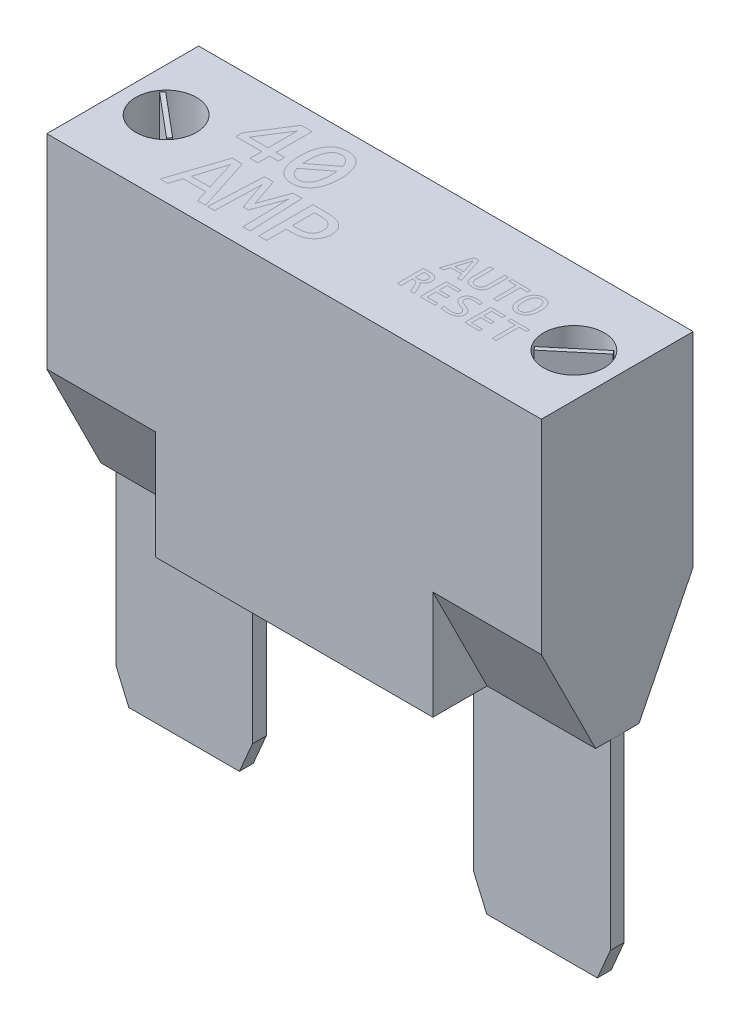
from build123d import *

# Parameters (mm, degrees)
SKETCH1_W              = 8.001
SKETCH1_H              = 0.8128
BOSS_EXTRUDE1_DEPTH    = 12.446
BOSS_EXTRUDE1_2_DEPTH  = 12.446
CUT_EXTRUDE8_DEPTH     = 0.8128
SKETCH7_W              = 28.956
SKETCH7_H              = 8.89
BOSS_EXTRUDE2_DEPTH    = 18.288
CUT_EXTRUDE9_DEPTH     = 6.35
CUT_EXTRUDE10_DEPTH    = 6.35
SKETCH10_R             = 1.778
CUT_EXTRUDE11_DEPTH    = 2.54
BOSS_EXTRUDE3_DEPTH    = 2.54
CUT_EXTRUDE12_DEPTH    = 0.0254
BOSS_EXTRUDE4_DEPTH    = 0.0254
BOSS_EXTRUDE4_2_DEPTH  = 0.0254
BOSS_EXTRUDE4_3_DEPTH  = 0.0254
BOSS_EXTRUDE4_4_DEPTH  = 0.0254
BOSS_EXTRUDE4_5_DEPTH  = 0.0254
BOSS_EXTRUDE4_6_DEPTH  = 0.0254
BOSS_EXTRUDE4_7_DEPTH  = 0.0254
BOSS_EXTRUDE4_8_DEPTH  = 0.0254
BOSS_EXTRUDE4_9_DEPTH  = 0.0254
BOSS_EXTRUDE4_10_DEPTH = 0.0254
BOSS_EXTRUDE4_11_DEPTH = 0.0254
BOSS_EXTRUDE4_12_DEPTH = 0.0254
BOSS_EXTRUDE4_13_DEPTH = 0.0254
BOSS_EXTRUDE4_14_DEPTH = 0.0254


with BuildPart() as part:
    # Sketch1 → Boss-Extrude1 (new body)
    with BuildSketch(Plane(origin=(0, 0, 0), x_dir=(1, 0, 0), z_dir=(0, 1, 0))):
        with Locations((-10.4775, 0)):
            Rectangle(SKETCH1_W, SKETCH1_H)
    extrude(amount=-BOSS_EXTRUDE1_DEPTH)


with BuildPart() as body_2:
    # Sketch1 → Boss-Extrude1 2 (new body)
    with BuildSketch(Plane(origin=(0, 0, 0), x_dir=(1, 0, 0), z_dir=(0, 1, 0))):
        with Locations((10.4775, 0)):
            Rectangle(SKETCH1_W, SKETCH1_H)
    extrude(amount=-BOSS_EXTRUDE1_2_DEPTH)


with BuildPart() as cut_extrude8_tool:
    # Sketch6 → Cut-Extrude8 (new body)
    with BuildSketch(Plane.XY.offset(0.4064)):
        Polygon((-14.478, -10.668), (-13.716, -12.446), (-14.478, -12.446), align=None)
        Polygon((-6.477, -10.668), (-7.239, -12.446), (-6.477, -12.446), align=None)
        Polygon((6.477, -12.446), (6.477, -10.668), (7.239, -12.446), align=None)
        Polygon((14.478, -10.668), (13.716, -12.446), (14.478, -12.446), align=None)
    extrude(amount=-CUT_EXTRUDE8_DEPTH)


with BuildPart() as part_1:
    add(part.part)

    # Cut-Extrude8: cut by cut_extrude8_tool
    add(cut_extrude8_tool.part, mode=Mode.SUBTRACT)


with BuildPart() as body_2_1:
    add(body_2.part)

    # Cut-Extrude8: cut by cut_extrude8_tool
    add(cut_extrude8_tool.part, mode=Mode.SUBTRACT)


with BuildPart() as body_3:
    # Sketch7 → Boss-Extrude2 (new body)
    with BuildSketch(Plane(origin=(0, 0, 0), x_dir=(1, 0, 0), z_dir=(0, 1, 0))):
        Rectangle(SKETCH7_W, SKETCH7_H)
    extrude(amount=BOSS_EXTRUDE2_DEPTH)

    # Sketch8 → Cut-Extrude9 (cut)
    with BuildSketch(Plane(origin=(14.478, 0, 0), x_dir=(0, 0, -1), z_dir=(1, 0, 0))):
        Polygon((-4.445, 6.35), (-1.27, 0), (-4.445, 0), align=None)
        Polygon((4.445, 6.35), (1.27, 0), (4.445, 0), align=None)
    extrude(amount=-CUT_EXTRUDE9_DEPTH, mode=Mode.SUBTRACT)

    # Sketch9 → Cut-Extrude10 (cut)
    with BuildSketch(Plane.ZY.offset(14.478)):
        Polygon((-4.445, 6.35), (-1.27, 0), (-4.445, 0), align=None)
        Polygon((4.445, 6.35), (1.27, 0), (4.445, 0), align=None)
    extrude(amount=-CUT_EXTRUDE10_DEPTH, mode=Mode.SUBTRACT)

    # Sketch10 → Cut-Extrude11 (cut)
    with BuildSketch(Plane(origin=(0, 18.288, 0), x_dir=(1, 0, 0), z_dir=(0, 1, 0))):
        with Locations(Location((-11.938, 0, 0), (0, 0, 270))):
            Circle(SKETCH10_R)
        with Locations(Location((11.938, 0, 0), (0, 0, 270))):
            Circle(SKETCH10_R)
    extrude(amount=-CUT_EXTRUDE11_DEPTH, mode=Mode.SUBTRACT)

    # Sketch11 → Boss-Extrude3 (add)
    with BuildSketch(Plane(origin=(0, 18.288, 0), x_dir=(1, 0, 0), z_dir=(0, 1, 0))):
        Polygon((-13.284373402, 0.963954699), (-10.754894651, -1.158529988), (-10.591626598, -0.963954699), (-13.121105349, 1.158529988), align=None)
        Polygon((13.280626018, 0.960810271), (10.758642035, -1.155385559), (10.595373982, -0.960810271), (13.117357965, 1.155385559), align=None)
    extrude(amount=-BOSS_EXTRUDE3_DEPTH)

    # Sketch12 → Cut-Extrude12 (cut)
    # profile 1 of 14: a face of its own
    with BuildSketch(Plane(origin=(0, 18.288, 0), x_dir=(1, 0, 0), z_dir=(0, 1, 0))):
        Polygon((-6.313188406, 0.944217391), (-6.819347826, 0.944217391), (-6.819347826, 0.254), (-7.279492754, 0.254), (-7.279492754, 0.944217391), (-8.797971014, 0.944217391), (-8.797971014, 1.312333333), (-7.454204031, 3.429), (-6.819347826, 3.429), (-6.819347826, 1.312333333), (-6.313188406, 1.312333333), align=None)
        Polygon((-7.279492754, 3.019183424), (-8.375931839, 1.312333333), (-7.279492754, 1.312333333), align=None, mode=Mode.SUBTRACT)
    # profile 2 of 14: a face of its own
    with BuildSketch(Plane(origin=(0, 18.288, 0), x_dir=(1, 0, 0), z_dir=(0, 1, 0))):
        with BuildLine():
            add(Edge.make_bspline(
                [(-3.598333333, 1.840062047), (-3.59898919, 1.780592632), (-3.600273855, 1.664106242), (-3.615371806, 1.493713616), (-3.637924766, 1.331079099), (-3.67013437, 1.17681535), (-3.711003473, 1.031453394), (-3.763472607, 0.896757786), (-3.823995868, 0.772141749), (-3.894702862, 0.65852318), (-3.97465172, 0.556671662), (-4.063903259, 0.466369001), (-4.162604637, 0.388488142), (-4.270783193, 0.323306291), (-4.388035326, 0.270633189), (-4.515711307, 0.234673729), (-4.652710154, 0.211539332), (-4.747398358, 0.209193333), (-4.796148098, 0.207985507)],
                knots=[0, 0, 0, 0, 1.248871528, 2.446241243, 3.590357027, 4.69618527, 5.754202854, 6.758290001, 7.728669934, 8.660396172, 9.563796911, 10.443071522, 11.321307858, 12.197637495, 13.090115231, 14.012601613, 14.976798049, 16, 16, 16, 16], degree=3))
            add(Edge.make_bspline(
                [(-4.796148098, 0.207985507), (-4.838390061, 0.209013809), (-4.921593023, 0.211039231), (-5.043392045, 0.229308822), (-5.159196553, 0.259800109), (-5.269216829, 0.301082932), (-5.372132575, 0.356275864), (-5.467401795, 0.42431595), (-5.555432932, 0.504872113), (-5.634721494, 0.599358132), (-5.706054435, 0.706813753), (-5.767933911, 0.828412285), (-5.821432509, 0.963027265), (-5.867106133, 1.111214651), (-5.901577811, 1.273702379), (-5.927474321, 1.449917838), (-5.942376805, 1.640408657), (-5.944153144, 1.771972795), (-5.945072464, 1.840062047)],
                knots=[0, 0, 0, 0, 0.897102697, 1.767001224, 2.609309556, 3.43771295, 4.257811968, 5.082953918, 5.919052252, 6.786174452, 7.6970727, 8.653553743, 9.679470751, 10.771494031, 11.944028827, 13.204944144, 14.553456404, 16, 16, 16, 16], degree=3))
            add(Edge.make_bspline(
                [(-5.945072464, 1.840062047), (-5.944000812, 1.899519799), (-5.941897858, 2.016196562), (-5.928524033, 2.187229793), (-5.904692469, 2.350258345), (-5.87197325, 2.504816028), (-5.829775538, 2.650351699), (-5.778230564, 2.785587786), (-5.717763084, 2.910244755), (-5.647839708, 3.024016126), (-5.568246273, 3.12626536), (-5.478749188, 3.2165907), (-5.379981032, 3.294730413), (-5.271145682, 3.35968117), (-5.153399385, 3.412240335), (-5.025768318, 3.448252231), (-4.889500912, 3.471432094), (-4.795528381, 3.473798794), (-4.747257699, 3.475014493)],
                knots=[0, 0, 0, 0, 1.248165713, 2.449334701, 3.598380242, 4.704508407, 5.763215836, 6.776019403, 7.739017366, 8.667464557, 9.574217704, 10.452902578, 11.330549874, 12.210601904, 13.107080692, 14.028948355, 14.987533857, 16, 16, 16, 16], degree=3))
            add(Edge.make_bspline(
                [(-4.747257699, 3.475014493), (-4.705014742, 3.473986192), (-4.621809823, 3.471960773), (-4.500254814, 3.453725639), (-4.38453197, 3.423308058), (-4.274951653, 3.380802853), (-4.171473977, 3.326481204), (-4.076458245, 3.257683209), (-3.988661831, 3.176679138), (-3.909583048, 3.081565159), (-3.837988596, 2.973720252), (-3.775540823, 2.85237969), (-3.722552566, 2.717269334), (-3.677435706, 2.569241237), (-3.641452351, 2.407036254), (-3.616034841, 2.230902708), (-3.600980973, 2.04020162), (-3.599237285, 1.908393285), (-3.598333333, 1.840062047)],
                knots=[0, 0, 0, 0, 0.896490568, 1.765795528, 2.602608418, 3.432274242, 4.256303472, 5.076742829, 5.915718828, 6.786140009, 7.696416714, 8.659101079, 9.677705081, 10.773848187, 11.941709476, 13.20176442, 14.549356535, 16, 16, 16, 16], degree=3))
        make_face()
        with BuildLine():
            add(Edge.make_bspline(
                [(-4.058478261, 1.815616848), (-4.058640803, 1.843190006), (-4.058964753, 1.898143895), (-4.065089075, 1.980034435), (-4.070208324, 2.060864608), (-4.075351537, 2.114242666), (-4.077890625, 2.140594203)],
                knots=[0, 0, 0, 0, 1.015676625, 2.024265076, 3.024624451, 4, 4, 4, 4], degree=3))
            Line((-4.077890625, 2.140594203), (-5.39505548, 1.128275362))
            add(Edge.make_bspline(
                [(-5.39505548, 1.128275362), (-5.38208987, 1.089432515), (-5.356659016, 1.013245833), (-5.307583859, 0.905840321), (-5.247431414, 0.80991215), (-5.175119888, 0.728243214), (-5.091043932, 0.662657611), (-5.012751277, 0.620807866), (-4.944456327, 0.598186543), (-4.889719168, 0.584851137), (-4.831304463, 0.578095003), (-4.791368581, 0.576775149), (-4.770983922, 0.576101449)],
                knots=[0, 0, 0, 0, 1.361870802, 2.671184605, 3.91877896, 5.116024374, 6.280451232, 7.450298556, 8.047911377, 8.670688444, 9.321473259, 10, 10, 10, 10], degree=3))
            add(Edge.make_bspline(
                [(-4.770983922, 0.576101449), (-4.744539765, 0.577014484), (-4.692405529, 0.578814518), (-4.616346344, 0.594737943), (-4.543755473, 0.618831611), (-4.4754957, 0.654166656), (-4.411088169, 0.698504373), (-4.352997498, 0.754325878), (-4.298300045, 0.817890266), (-4.249686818, 0.891854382), (-4.20587018, 0.974991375), (-4.166886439, 1.067515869), (-4.134263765, 1.169635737), (-4.107123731, 1.281174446), (-4.084788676, 1.401614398), (-4.069295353, 1.531525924), (-4.059832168, 1.670480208), (-4.058938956, 1.766231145), (-4.058478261, 1.815616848)],
                knots=[0, 0, 0, 0, 0.796240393, 1.569775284, 2.332781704, 3.095240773, 3.878796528, 4.681173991, 5.516437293, 6.40201063, 7.34239963, 8.345981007, 9.424260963, 10.57011489, 11.804224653, 13.114209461, 14.5115885, 16, 16, 16, 16], degree=3))
        make_face(mode=Mode.SUBTRACT)
        with BuildLine():
            add(Edge.make_bspline(
                [(-5.484927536, 1.845094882), (-5.484957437, 1.819451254), (-5.48501724, 1.768162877), (-5.484571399, 1.691694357), (-5.482034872, 1.616359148), (-5.477712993, 1.566836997), (-5.475580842, 1.542405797)],
                knots=[0, 0, 0, 0, 1.015676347, 2.03139705, 3.028811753, 4, 4, 4, 4], degree=3))
            Line((-5.475580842, 1.542405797), (-4.157697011, 2.554724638))
            add(Edge.make_bspline(
                [(-4.157697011, 2.554724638), (-4.170160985, 2.594159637), (-4.19439935, 2.670847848), (-4.245732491, 2.776869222), (-4.304360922, 2.872552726), (-4.37666754, 2.952914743), (-4.458499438, 3.020126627), (-4.536699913, 3.060885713), (-4.603598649, 3.084911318), (-4.657284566, 3.098105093), (-4.714011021, 3.104887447), (-4.752754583, 3.1062214), (-4.772421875, 3.106898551)],
                knots=[0, 0, 0, 0, 1.387569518, 2.698370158, 3.946895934, 5.144331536, 6.312393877, 7.486406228, 8.084826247, 8.697958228, 9.339048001, 10, 10, 10, 10], degree=3))
            add(Edge.make_bspline(
                [(-4.772421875, 3.106898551), (-4.798856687, 3.105958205), (-4.850972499, 3.104104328), (-4.927020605, 3.08860381), (-4.999283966, 3.063016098), (-5.067823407, 3.02762156), (-5.132347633, 2.982283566), (-5.190590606, 2.925490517), (-5.246101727, 2.860876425), (-5.294337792, 2.784545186), (-5.338236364, 2.69967695), (-5.376522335, 2.60503517), (-5.408910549, 2.501015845), (-5.437364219, 2.387852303), (-5.458347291, 2.265223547), (-5.47419079, 2.13351063), (-5.483547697, 1.992381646), (-5.484458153, 1.895197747), (-5.484927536, 1.845094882)],
                knots=[0, 0, 0, 0, 0.786453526, 1.550480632, 2.299704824, 3.062398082, 3.840423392, 4.637837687, 5.478332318, 6.370910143, 7.318703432, 8.320397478, 9.40580758, 10.560070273, 11.791787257, 13.106920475, 14.508481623, 16, 16, 16, 16], degree=3))
        make_face(mode=Mode.SUBTRACT)
    # profile 3 of 14: a face of its own
    with BuildSketch(Plane(origin=(0, 18.288, 0), x_dir=(1, 0, 0), z_dir=(0, 1, 0))):
        Polygon((-6.198152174, -3.429), (-6.669081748, -3.429), (-6.881898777, -2.738782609), (-8.200501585, -2.738782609), (-8.418351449, -3.429), (-8.866992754, -3.429), (-7.811535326, -0.254), (-7.219817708, -0.254), align=None)
        Polygon((-6.99477808, -2.370666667), (-7.532572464, -0.624272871), (-8.0840274, -2.370666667), align=None, mode=Mode.SUBTRACT)
    # profile 4 of 14: a face of its own
    with BuildSketch(Plane(origin=(0, 18.288, 0), x_dir=(1, 0, 0), z_dir=(0, 1, 0))):
        Polygon((-3.590424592, -3.429), (-4.012463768, -3.429), (-4.06063519, -1.415865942), (-4.081485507, -0.693294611), (-4.231751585, -1.123242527), (-4.706995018, -2.416681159), (-5.006089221, -2.416681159), (-5.45185462, -1.172132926), (-5.599963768, -0.693294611), (-5.610029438, -1.450376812), (-5.668985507, -3.429), (-6.076645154, -3.429), (-5.918470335, -0.254), (-5.405840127, -0.254), (-4.978768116, -1.483449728), (-4.840724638, -1.898299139), (-4.704838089, -1.483449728), (-4.24900702, -0.254), (-3.722716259, -0.254), align=None)
    # profile 5 of 14: a face of its own
    with BuildSketch(Plane(origin=(0, 18.288, 0), x_dir=(1, 0, 0), z_dir=(0, 1, 0))):
        with BuildLine():
            add(Edge.make_bspline(
                [(-1.021521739, -1.220304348), (-1.022298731, -1.252467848), (-1.023859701, -1.317084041), (-1.038270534, -1.413548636), (-1.060585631, -1.509496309), (-1.09123982, -1.604296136), (-1.131441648, -1.696547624), (-1.181678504, -1.784606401), (-1.243089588, -1.866818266), (-1.312558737, -1.944933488), (-1.392881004, -2.016328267), (-1.483672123, -2.080655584), (-1.584674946, -2.137925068), (-1.695586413, -2.188887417), (-1.817860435, -2.228879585), (-1.951157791, -2.258556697), (-2.095952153, -2.27552576), (-2.196284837, -2.277577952), (-2.248095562, -2.278637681)],
                knots=[0, 0, 0, 0, 0.84837333, 1.704374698, 2.568122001, 3.446177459, 4.329841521, 5.219461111, 6.115085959, 7.03322926, 7.973947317, 8.94447037, 9.964314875, 11.034235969, 12.160282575, 13.352588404, 14.632904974, 16, 16, 16, 16], degree=3))
            Line((-2.248095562, -2.278637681), (-2.632028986, -2.278637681))
            Line((-2.632028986, -2.278637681), (-2.632028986, -3.429))
            Line((-2.632028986, -3.429), (-3.092173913, -3.429))
            Line((-3.092173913, -3.429), (-3.092173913, -0.254))
            Line((-3.092173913, -0.254), (-2.204237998, -0.254))
            add(Edge.make_bspline(
                [(-2.204237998, -0.254), (-2.165626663, -0.254408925), (-2.088986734, -0.255220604), (-1.975512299, -0.26608648), (-1.864232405, -0.281393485), (-1.756052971, -0.304276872), (-1.652177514, -0.334298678), (-1.553491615, -0.370943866), (-1.462721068, -0.418740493), (-1.377484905, -0.472299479), (-1.298984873, -0.534126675), (-1.229925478, -0.60587632), (-1.169018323, -0.685806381), (-1.11626744, -0.773728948), (-1.072835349, -0.871133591), (-1.043645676, -0.979056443), (-1.024049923, -1.096408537), (-1.022384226, -1.178037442), (-1.021521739, -1.220304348)],
                knots=[0, 0, 0, 0, 1.071095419, 2.126025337, 3.160633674, 4.187194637, 5.191188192, 6.159546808, 7.102471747, 8.032359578, 8.950543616, 9.867691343, 10.788184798, 11.733733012, 12.707489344, 13.737062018, 14.82826569, 16, 16, 16, 16], degree=3))
        make_face()
        with BuildLine():
            add(Edge.make_bspline(
                [(-1.481666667, -1.244749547), (-1.482125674, -1.220271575), (-1.483020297, -1.172563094), (-1.492637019, -1.103471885), (-1.507780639, -1.038707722), (-1.528408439, -0.978326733), (-1.555149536, -0.92214918), (-1.58858606, -0.870943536), (-1.627658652, -0.823641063), (-1.673029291, -0.781357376), (-1.72380653, -0.744137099), (-1.778466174, -0.710492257), (-1.838770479, -0.683304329), (-1.903889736, -0.661264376), (-1.97346432, -0.642942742), (-2.048168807, -0.63141261), (-2.127109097, -0.622851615), (-2.181444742, -0.622365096), (-2.209270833, -0.622115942)],
                knots=[0, 0, 0, 0, 1.07893025, 2.102875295, 3.069403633, 4.00867391, 4.911619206, 5.805799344, 6.69897942, 7.61127936, 8.532960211, 9.47193309, 10.436783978, 11.442898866, 12.50165651, 13.605056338, 14.773513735, 16, 16, 16, 16], degree=3))
            Line((-2.209270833, -0.622115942), (-2.632028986, -0.622115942))
            Line((-2.632028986, -0.622115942), (-2.632028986, -1.910521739))
            Line((-2.632028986, -1.910521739), (-2.245938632, -1.910521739))
            add(Edge.make_bspline(
                [(-2.245938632, -1.910521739), (-2.216207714, -1.909876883), (-2.158575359, -1.908626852), (-2.074450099, -1.901620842), (-1.995499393, -1.889019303), (-1.922081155, -1.870063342), (-1.853879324, -1.847177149), (-1.790772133, -1.819220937), (-1.733084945, -1.785172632), (-1.680364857, -1.746363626), (-1.632975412, -1.702421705), (-1.592725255, -1.652164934), (-1.557892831, -1.597344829), (-1.529579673, -1.536968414), (-1.508387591, -1.471147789), (-1.492479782, -1.40043915), (-1.483020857, -1.324333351), (-1.482127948, -1.271858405), (-1.481666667, -1.244749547)],
                knots=[0, 0, 0, 0, 1.232805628, 2.389751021, 3.4973379, 4.54330244, 5.530003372, 6.477393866, 7.399377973, 8.301660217, 9.187431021, 10.070466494, 10.963674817, 11.874940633, 12.827061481, 13.825105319, 14.876436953, 16, 16, 16, 16], degree=3))
        make_face(mode=Mode.SUBTRACT)
    # profile 6 of 14: a face of its own
    with BuildSketch(Plane(origin=(0, 18.288, 0), x_dir=(1, 0, 0), z_dir=(0, 1, 0))):
        Polygon((5.102086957, 0.254), (4.876040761, 0.254), (4.773888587, 0.585304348), (4.140959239, 0.585304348), (4.036391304, 0.254), (3.821043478, 0.254), (4.327663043, 1.778), (4.6116875, 1.778), align=None)
        Polygon((4.719706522, 0.762), (4.461565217, 1.600269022), (4.196866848, 0.762), align=None, mode=Mode.SUBTRACT)
    # profile 7 of 14: a face of its own
    with BuildSketch(Plane(origin=(0, 18.288, 0), x_dir=(1, 0, 0), z_dir=(0, 1, 0))):
        with BuildLine():
            add(Edge.make_bspline(
                [(6.327913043, 0.783741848), (6.327401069, 0.763250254), (6.326397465, 0.723081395), (6.319949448, 0.664264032), (6.308504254, 0.608502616), (6.292755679, 0.555855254), (6.272253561, 0.506672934), (6.247900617, 0.460940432), (6.218891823, 0.419076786), (6.185770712, 0.380997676), (6.148254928, 0.347084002), (6.106944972, 0.317209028), (6.061611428, 0.291626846), (6.012634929, 0.269696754), (5.95953003, 0.25304329), (5.902893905, 0.24040343), (5.842299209, 0.233243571), (5.800605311, 0.232364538), (5.779190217, 0.231913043)],
                knots=[0, 0, 0, 0, 1.11533168, 2.186340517, 3.215329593, 4.209637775, 5.172397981, 6.11082755, 7.024364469, 7.938480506, 8.851566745, 9.770835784, 10.707404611, 11.680049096, 12.68592053, 13.731069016, 14.834616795, 16, 16, 16, 16], degree=3))
            add(Edge.make_bspline(
                [(5.779190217, 0.231913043), (5.755820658, 0.232369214), (5.710927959, 0.233245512), (5.646251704, 0.24010471), (5.587095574, 0.251716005), (5.533126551, 0.267822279), (5.484513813, 0.28869025), (5.440631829, 0.313299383), (5.401320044, 0.341615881), (5.366831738, 0.374046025), (5.336978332, 0.410149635), (5.311779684, 0.449813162), (5.290457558, 0.492675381), (5.273696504, 0.539035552), (5.261070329, 0.588432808), (5.252208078, 0.640611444), (5.246491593, 0.695496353), (5.245936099, 0.733111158), (5.245652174, 0.752336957)],
                knots=[0, 0, 0, 0, 1.312563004, 2.521420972, 3.648051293, 4.694693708, 5.678954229, 6.613532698, 7.515738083, 8.393474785, 9.265531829, 10.140290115, 11.027490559, 11.949473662, 12.903968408, 13.887719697, 14.920364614, 16, 16, 16, 16], degree=3))
            Line((5.245652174, 0.752336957), (5.245652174, 1.778))
            Line((5.245652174, 1.778), (5.466521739, 1.778))
            Line((5.466521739, 1.778), (5.466521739, 0.770627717))
            add(Edge.make_bspline(
                [(5.466521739, 0.770627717), (5.46670342, 0.756126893), (5.467054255, 0.728125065), (5.470227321, 0.687452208), (5.475294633, 0.649514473), (5.482475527, 0.614183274), (5.491864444, 0.581383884), (5.504937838, 0.551786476), (5.519581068, 0.524333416), (5.537771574, 0.500087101), (5.55847948, 0.478573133), (5.582103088, 0.459978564), (5.608420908, 0.44413211), (5.637661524, 0.430851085), (5.670172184, 0.420941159), (5.705778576, 0.413857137), (5.744787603, 0.409201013), (5.771928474, 0.408811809), (5.786092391, 0.408608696)],
                knots=[0, 0, 0, 0, 1.246642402, 2.407329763, 3.505429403, 4.535490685, 5.505633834, 6.431662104, 7.312644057, 8.175164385, 9.028562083, 9.873549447, 10.752251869, 11.664173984, 12.627739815, 13.667491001, 14.782741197, 16, 16, 16, 16], degree=3))
            add(Edge.make_bspline(
                [(5.786092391, 0.408608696), (5.799333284, 0.408839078), (5.825091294, 0.409287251), (5.862325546, 0.413728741), (5.896826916, 0.421444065), (5.928772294, 0.431594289), (5.95791951, 0.445167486), (5.984498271, 0.46154225), (6.008515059, 0.480811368), (6.02927842, 0.50366193), (6.047593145, 0.528947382), (6.063516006, 0.55672893), (6.076981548, 0.586919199), (6.088012, 0.619510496), (6.096569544, 0.654502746), (6.102838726, 0.691863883), (6.106108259, 0.731687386), (6.106725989, 0.759003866), (6.107043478, 0.773043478)],
                knots=[0, 0, 0, 0, 1.143906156, 2.225283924, 3.233450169, 4.19541835, 5.116075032, 6.004390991, 6.887798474, 7.767169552, 8.663955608, 9.581332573, 10.529122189, 11.516238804, 12.550580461, 13.639017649, 14.7865465, 16, 16, 16, 16], degree=3))
            Line((6.107043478, 0.773043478), (6.107043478, 1.778))
            Line((6.107043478, 1.778), (6.327913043, 1.778))
            Line((6.327913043, 1.778), (6.327913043, 0.783741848))
        make_face()
    # profile 8 of 14: a face of its own
    with BuildSketch(Plane(origin=(0, 18.288, 0), x_dir=(1, 0, 0), z_dir=(0, 1, 0))):
        Polygon((7.631043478, 1.601304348), (7.189304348, 1.601304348), (7.189304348, 0.254), (6.968434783, 0.254), (6.968434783, 1.601304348), (6.526695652, 1.601304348), (6.526695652, 1.778), (7.631043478, 1.778), align=None)
    # profile 9 of 14: a face of its own
    with BuildSketch(Plane(origin=(0, 18.288, 0), x_dir=(1, 0, 0), z_dir=(0, 1, 0))):
        with BuildLine():
            add(Edge.make_bspline(
                [(8.95626087, 1.026008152), (8.955688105, 0.992855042), (8.95458209, 0.928835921), (8.945471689, 0.836337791), (8.931024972, 0.750717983), (8.909947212, 0.672110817), (8.883489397, 0.600532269), (8.853629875, 0.535039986), (8.819084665, 0.476155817), (8.780388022, 0.42366151), (8.737624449, 0.378010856), (8.691917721, 0.337880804), (8.64175406, 0.30527639), (8.588940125, 0.278161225), (8.533485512, 0.257569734), (8.476402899, 0.242592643), (8.417699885, 0.233857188), (8.378116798, 0.232564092), (8.3581875, 0.231913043)],
                knots=[0, 0, 0, 0, 1.423082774, 2.747992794, 3.986236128, 5.147128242, 6.236197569, 7.259302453, 8.233395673, 9.161912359, 10.053001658, 10.914402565, 11.766421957, 12.614596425, 13.458547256, 14.300675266, 15.144423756, 16, 16, 16, 16], degree=3))
            add(Edge.make_bspline(
                [(8.3581875, 0.231913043), (8.334681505, 0.232554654), (8.289055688, 0.233800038), (8.222961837, 0.244031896), (8.1615016, 0.260417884), (8.104617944, 0.283673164), (8.052755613, 0.31358751), (8.005145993, 0.349059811), (7.962545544, 0.39089019), (7.924449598, 0.438394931), (7.891155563, 0.491750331), (7.862676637, 0.550621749), (7.838465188, 0.614848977), (7.818962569, 0.68439114), (7.803898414, 0.758926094), (7.793461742, 0.838147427), (7.786662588, 0.921781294), (7.785994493, 0.979059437), (7.785652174, 1.008407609)],
                knots=[0, 0, 0, 0, 1.030115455, 1.999483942, 2.924432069, 3.813267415, 4.685316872, 5.542716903, 6.40939724, 7.295524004, 8.206506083, 9.160640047, 10.158252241, 11.211975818, 12.323750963, 13.4892538, 14.713543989, 16, 16, 16, 16], degree=3))
            add(Edge.make_bspline(
                [(7.785652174, 1.008407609), (7.786271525, 1.041211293), (7.787469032, 1.104636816), (7.79598738, 1.196492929), (7.810640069, 1.281583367), (7.831349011, 1.359957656), (7.857288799, 1.43155702), (7.887361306, 1.496827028), (7.921273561, 1.555916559), (7.960288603, 1.608002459), (8.002992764, 1.653789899), (8.048747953, 1.693805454), (8.098462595, 1.726826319), (8.150990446, 1.753903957), (8.206261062, 1.774358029), (8.263195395, 1.789459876), (8.321799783, 1.798133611), (8.361381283, 1.799432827), (8.381309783, 1.800086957)],
                knots=[0, 0, 0, 0, 1.41309666, 2.732205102, 3.969807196, 5.128608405, 6.219709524, 7.24631839, 8.221244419, 9.148965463, 10.043106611, 10.914447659, 11.761129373, 12.607796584, 13.454637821, 14.294855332, 15.141493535, 16, 16, 16, 16], degree=3))
            add(Edge.make_bspline(
                [(8.381309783, 1.800086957), (8.404811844, 1.799425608), (8.450543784, 1.798138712), (8.516723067, 1.78815197), (8.578122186, 1.771164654), (8.634798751, 1.747579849), (8.686920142, 1.717693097), (8.734428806, 1.68196955), (8.77744088, 1.640449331), (8.815269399, 1.592861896), (8.848972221, 1.539861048), (8.878365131, 1.481570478), (8.902284, 1.417420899), (8.922318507, 1.348334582), (8.937603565, 1.274226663), (8.94858579, 1.195498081), (8.955216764, 1.112285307), (8.955907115, 1.055239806), (8.95626087, 1.026008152)],
                knots=[0, 0, 0, 0, 1.031800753, 2.007749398, 2.930678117, 3.822900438, 4.696376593, 5.562252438, 6.426830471, 7.314406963, 8.225311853, 9.18096675, 10.175487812, 11.227471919, 12.337140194, 13.495232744, 14.716489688, 16, 16, 16, 16], degree=3))
        make_face()
        with BuildLine():
            add(Edge.make_bspline(
                [(8.735391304, 1.011168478), (8.735057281, 1.033257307), (8.73440275, 1.076541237), (8.731309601, 1.140040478), (8.724395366, 1.200544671), (8.716110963, 1.25809323), (8.704899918, 1.312358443), (8.690308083, 1.362821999), (8.673353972, 1.409692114), (8.652552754, 1.452324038), (8.628741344, 1.490716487), (8.602109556, 1.525200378), (8.571587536, 1.554466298), (8.538101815, 1.579430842), (8.501223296, 1.599329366), (8.460632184, 1.613606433), (8.416389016, 1.621905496), (8.38571685, 1.622886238), (8.369921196, 1.623391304)],
                knots=[0, 0, 0, 0, 1.323673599, 2.593790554, 3.807090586, 4.970987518, 6.076778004, 7.123914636, 8.116191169, 9.059475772, 9.960330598, 10.819370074, 11.662669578, 12.485668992, 13.315223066, 14.163241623, 15.054100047, 16, 16, 16, 16], degree=3))
            add(Edge.make_bspline(
                [(8.369921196, 1.623391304), (8.354586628, 1.62275306), (8.324700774, 1.621509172), (8.281340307, 1.613027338), (8.241636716, 1.597536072), (8.205341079, 1.576534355), (8.172413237, 1.550514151), (8.143038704, 1.519552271), (8.115917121, 1.485141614), (8.092412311, 1.446085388), (8.072471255, 1.403155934), (8.054052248, 1.357017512), (8.03976136, 1.306940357), (8.027116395, 1.253921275), (8.018065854, 1.198182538), (8.011648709, 1.140583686), (8.007254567, 1.081292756), (8.006768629, 1.041200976), (8.006521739, 1.020831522)],
                knots=[0, 0, 0, 0, 0.938104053, 1.828290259, 2.688226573, 3.533173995, 4.38495139, 5.245952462, 6.138444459, 7.060521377, 8.026891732, 9.031849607, 10.096184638, 11.209149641, 12.36492099, 13.547735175, 14.754076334, 16, 16, 16, 16], degree=3))
            add(Edge.make_bspline(
                [(8.006521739, 1.020831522), (8.006793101, 0.998508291), (8.007322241, 0.954979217), (8.011266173, 0.891086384), (8.01722294, 0.830243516), (8.026182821, 0.772514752), (8.037731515, 0.718409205), (8.052239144, 0.668115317), (8.069410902, 0.621627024), (8.089585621, 0.579051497), (8.113269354, 0.540816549), (8.139666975, 0.506535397), (8.170205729, 0.477604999), (8.202883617, 0.452116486), (8.239851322, 0.432689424), (8.280023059, 0.41847925), (8.323904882, 0.410058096), (8.354238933, 0.409102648), (8.369921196, 0.408608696)],
                knots=[0, 0, 0, 0, 1.340540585, 2.613980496, 3.843097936, 5.010722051, 6.120504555, 7.163418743, 8.151508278, 9.093960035, 9.987380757, 10.848401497, 11.683877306, 12.507385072, 13.329500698, 14.179475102, 15.05881515, 16, 16, 16, 16], degree=3))
            add(Edge.make_bspline(
                [(8.369921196, 0.408608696), (8.385269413, 0.409187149), (8.415092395, 0.410311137), (8.458137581, 0.419572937), (8.498013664, 0.434422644), (8.534485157, 0.455483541), (8.567747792, 0.481480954), (8.59750753, 0.512328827), (8.624599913, 0.5469495), (8.648384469, 0.585982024), (8.66928575, 0.628653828), (8.687265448, 0.674983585), (8.70242504, 0.724575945), (8.714217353, 0.777601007), (8.724009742, 0.8330763), (8.730237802, 0.890848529), (8.734667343, 0.950360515), (8.735147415, 0.990683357), (8.735391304, 1.011168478)],
                knots=[0, 0, 0, 0, 0.936906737, 1.820494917, 2.676828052, 3.526792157, 4.383009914, 5.247809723, 6.13916262, 7.06372975, 8.034989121, 9.038664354, 10.096936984, 11.200050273, 12.355522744, 13.536827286, 14.74863997, 16, 16, 16, 16], degree=3))
        make_face(mode=Mode.SUBTRACT)
    # profile 10 of 14: a face of its own
    with BuildSketch(Plane(origin=(0, 18.288, 0), x_dir=(1, 0, 0), z_dir=(0, 1, 0))):
        with BuildLine():
            Line((4.389782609, -1.778), (4.155798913, -1.778))
            Line((4.155798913, -1.778), (3.936654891, -1.302095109))
            add(Edge.make_bspline(
                [(3.936654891, -1.302095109), (3.928736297, -1.285222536), (3.914046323, -1.25392182), (3.888181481, -1.212821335), (3.861392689, -1.179706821), (3.832374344, -1.154248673), (3.800716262, -1.135675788), (3.766217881, -1.123659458), (3.728378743, -1.116674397), (3.702012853, -1.115832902), (3.68817663, -1.115391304)],
                knots=[0, 0, 0, 0, 1.339134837, 2.484261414, 3.482991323, 4.391871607, 5.244507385, 6.105289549, 7.005698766, 8, 8, 8, 8], degree=3))
            Line((3.68817663, -1.115391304), (3.594652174, -1.115391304))
            Line((3.594652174, -1.115391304), (3.594652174, -1.778))
            Line((3.594652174, -1.778), (3.373782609, -1.778))
            Line((3.373782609, -1.778), (3.373782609, -0.254))
            Line((3.373782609, -0.254), (3.778940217, -0.254))
            add(Edge.make_bspline(
                [(3.778940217, -0.254), (3.800235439, -0.254275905), (3.841293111, -0.254807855), (3.900576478, -0.260415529), (3.955224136, -0.269461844), (4.005151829, -0.282696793), (4.050697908, -0.298868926), (4.092018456, -0.318194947), (4.129119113, -0.340562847), (4.16185814, -0.366084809), (4.19080053, -0.393936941), (4.215088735, -0.425134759), (4.235684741, -0.458737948), (4.25184858, -0.49525887), (4.26410452, -0.533976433), (4.273252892, -0.574707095), (4.278360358, -0.617497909), (4.279015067, -0.646720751), (4.279347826, -0.66157337)],
                knots=[0, 0, 0, 0, 1.390037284, 2.680023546, 3.883960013, 5.002565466, 6.047913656, 7.03574216, 7.976084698, 8.870016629, 9.741095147, 10.591561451, 11.444313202, 12.308368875, 13.191986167, 14.092206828, 15.030357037, 16, 16, 16, 16], degree=3))
            add(Edge.make_bspline(
                [(4.279347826, -0.66157337), (4.279072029, -0.673548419), (4.278529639, -0.697098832), (4.274543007, -0.731919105), (4.26850657, -0.765782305), (4.259461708, -0.798531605), (4.24805571, -0.830039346), (4.234280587, -0.860280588), (4.21756422, -0.888921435), (4.198642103, -0.916260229), (4.177112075, -0.941855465), (4.15333414, -0.965793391), (4.126739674, -0.987511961), (4.098355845, -1.007918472), (4.067406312, -1.025974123), (4.034203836, -1.041401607), (3.998917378, -1.054672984), (3.974334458, -1.061296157), (3.961847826, -1.064660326)],
                knots=[0, 0, 0, 0, 1.032708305, 2.030948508, 3.019625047, 3.996933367, 4.957424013, 5.907556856, 6.85893238, 7.814077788, 8.77200233, 9.740252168, 10.719774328, 11.730219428, 12.753012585, 13.805036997, 14.885091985, 16, 16, 16, 16], degree=3))
            add(Edge.make_bspline(
                [(3.961847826, -1.064660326), (3.971996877, -1.068382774), (3.992133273, -1.075768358), (4.019819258, -1.092215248), (4.04585896, -1.111332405), (4.068631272, -1.135764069), (4.090896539, -1.163282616), (4.112966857, -1.194991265), (4.135378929, -1.230774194), (4.149492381, -1.256577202), (4.156834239, -1.27)],
                knots=[0, 0, 0, 0, 0.890820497, 1.767447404, 2.649001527, 3.549193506, 4.515009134, 5.571837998, 6.736863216, 8, 8, 8, 8], degree=3))
            Line((4.156834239, -1.27), (4.389782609, -1.778))
        make_face()
        with BuildLine():
            add(Edge.make_bspline(
                [(4.058478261, -0.676413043), (4.058316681, -0.666394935), (4.058003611, -0.646984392), (4.054538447, -0.618886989), (4.048608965, -0.59279996), (4.040710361, -0.568626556), (4.030841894, -0.546139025), (4.017753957, -0.526112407), (4.002981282, -0.507686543), (3.985917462, -0.491343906), (3.966700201, -0.477127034), (3.945585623, -0.464770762), (3.922769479, -0.453998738), (3.898028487, -0.445305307), (3.871394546, -0.438949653), (3.842941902, -0.433994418), (3.812580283, -0.431359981), (3.791713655, -0.430920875), (3.78101087, -0.430695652)],
                knots=[0, 0, 0, 0, 1.136086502, 2.201219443, 3.204852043, 4.166451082, 5.083443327, 5.98129036, 6.87199526, 7.758098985, 8.653381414, 9.577773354, 10.529401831, 11.511765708, 12.546811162, 13.632454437, 14.78565276, 16, 16, 16, 16], degree=3))
            Line((3.78101087, -0.430695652), (3.594652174, -0.430695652))
            Line((3.594652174, -0.430695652), (3.594652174, -0.938695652))
            Line((3.594652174, -0.938695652), (3.7544375, -0.938695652))
            add(Edge.make_bspline(
                [(3.7544375, -0.938695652), (3.765830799, -0.93849203), (3.788086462, -0.938094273), (3.820551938, -0.935144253), (3.851137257, -0.929324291), (3.880145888, -0.922441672), (3.90715579, -0.912680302), (3.932028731, -0.900870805), (3.955183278, -0.887499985), (3.975789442, -0.871446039), (3.994682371, -0.853792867), (4.011217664, -0.834084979), (4.025602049, -0.812500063), (4.037215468, -0.788743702), (4.047132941, -0.763347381), (4.053374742, -0.735771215), (4.057773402, -0.706693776), (4.058239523, -0.686669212), (4.058478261, -0.676413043)],
                knots=[0, 0, 0, 0, 1.202615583, 2.349188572, 3.435207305, 4.486530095, 5.492783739, 6.45958443, 7.390413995, 8.308405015, 9.210274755, 10.115082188, 11.017605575, 11.940721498, 12.901403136, 13.887978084, 14.918265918, 16, 16, 16, 16], degree=3))
        make_face(mode=Mode.SUBTRACT)
    # profile 11 of 14: a face of its own
    with BuildSketch(Plane(origin=(0, 18.288, 0), x_dir=(1, 0, 0), z_dir=(0, 1, 0))):
        Polygon((5.582478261, -1.778), (4.721086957, -1.778), (4.721086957, -0.254), (5.582478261, -0.254), (5.582478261, -0.430695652), (4.941956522, -0.430695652), (4.941956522, -0.894521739), (5.556940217, -0.894521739), (5.556940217, -1.071217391), (4.941956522, -1.071217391), (4.941956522, -1.601304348), (5.582478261, -1.601304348), align=None)
    # profile 12 of 14: a face of its own
    with BuildSketch(Plane(origin=(0, 18.288, 0), x_dir=(1, 0, 0), z_dir=(0, 1, 0))):
        with BuildLine():
            add(Edge.make_bspline(
                [(6.951869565, -1.365595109), (6.951373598, -1.383229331), (6.950411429, -1.417439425), (6.941946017, -1.467219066), (6.927828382, -1.513456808), (6.908428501, -1.556469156), (6.883471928, -1.595474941), (6.854965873, -1.631881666), (6.820927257, -1.663905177), (6.783218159, -1.693064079), (6.741249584, -1.718725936), (6.69491414, -1.740322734), (6.644847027, -1.758980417), (6.590909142, -1.774024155), (6.533582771, -1.785718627), (6.473150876, -1.793752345), (6.40991708, -1.799174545), (6.366807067, -1.799778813), (6.34482337, -1.800086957)],
                knots=[0, 0, 0, 0, 1.005643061, 1.95093061, 2.870738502, 3.757832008, 4.633806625, 5.507195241, 6.389247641, 7.292512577, 8.223494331, 9.189475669, 10.205094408, 11.269007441, 12.381228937, 13.540657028, 14.745872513, 16, 16, 16, 16], degree=3))
            add(Edge.make_bspline(
                [(6.34482337, -1.800086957), (6.324574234, -1.799860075), (6.284172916, -1.799407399), (6.224092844, -1.796632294), (6.165315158, -1.792047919), (6.108718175, -1.786535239), (6.054730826, -1.780407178), (6.004068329, -1.77331994), (5.957369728, -1.765079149), (5.927802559, -1.758861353), (5.913782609, -1.755913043)],
                knots=[0, 0, 0, 0, 1.119729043, 2.234096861, 3.324996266, 4.379512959, 5.378439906, 6.329323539, 7.207810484, 8, 8, 8, 8], degree=3))
            Line((5.913782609, -1.755913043), (5.913782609, -1.557130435))
            add(Edge.make_bspline(
                [(5.913782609, -1.557130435), (5.928792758, -1.562273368), (5.959462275, -1.572781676), (6.007570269, -1.585106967), (6.058033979, -1.596682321), (6.111332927, -1.606352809), (6.167986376, -1.613963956), (6.228210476, -1.619316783), (6.292207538, -1.622941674), (6.336075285, -1.623238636), (6.358627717, -1.623391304)],
                knots=[0, 0, 0, 0, 0.842364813, 1.72116351, 2.635659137, 3.591954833, 4.596841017, 5.670471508, 6.802388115, 8, 8, 8, 8], degree=3))
            add(Edge.make_bspline(
                [(6.358627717, -1.623391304), (6.374740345, -1.62322544), (6.405732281, -1.622906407), (6.450390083, -1.619570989), (6.491398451, -1.615222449), (6.528669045, -1.607669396), (6.562575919, -1.598975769), (6.59322346, -1.587912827), (6.620563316, -1.574747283), (6.645072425, -1.559988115), (6.666077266, -1.54293522), (6.684492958, -1.524557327), (6.699271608, -1.504055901), (6.711276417, -1.481917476), (6.720150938, -1.458067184), (6.726313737, -1.432568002), (6.730190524, -1.40551557), (6.730725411, -1.386890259), (6.731, -1.377328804)],
                knots=[0, 0, 0, 0, 1.523194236, 2.929797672, 4.233142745, 5.41923506, 6.522104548, 7.540643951, 8.494207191, 9.387815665, 10.238903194, 11.04655015, 11.840679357, 12.619387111, 13.4214478, 14.239285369, 15.096122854, 16, 16, 16, 16], degree=3))
            add(Edge.make_bspline(
                [(6.731, -1.377328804), (6.73065732, -1.367393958), (6.729987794, -1.347983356), (6.723149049, -1.320135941), (6.712456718, -1.294311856), (6.696781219, -1.271280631), (6.678359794, -1.249640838), (6.656718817, -1.229811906), (6.632830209, -1.210637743), (6.596582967, -1.18652538), (6.54586302, -1.158192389), (6.478298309, -1.129858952), (6.40665007, -1.101410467), (6.333119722, -1.071738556), (6.259608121, -1.040241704), (6.187490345, -1.006874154), (6.119852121, -0.968594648), (6.068919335, -0.930611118), (6.033334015, -0.896408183), (6.009124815, -0.869022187), (5.988352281, -0.839116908), (5.969163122, -0.807750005), (5.95415029, -0.773086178), (5.943734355, -0.73545116), (5.936821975, -0.694840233), (5.936194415, -0.666780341), (5.935869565, -0.652255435)],
                knots=[0, 0, 0, 0, 0.619815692, 1.2109895, 1.781199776, 2.357496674, 2.943929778, 3.554333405, 4.188738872, 4.856760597, 6.272963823, 7.811824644, 9.431291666, 11.092170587, 12.76691914, 14.429617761, 16.056218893, 17.616396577, 18.384212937, 19.138341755, 19.896401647, 20.65718422, 21.4332038, 22.247956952, 23.09307348, 24, 24, 24, 24], degree=3))
            add(Edge.make_bspline(
                [(5.935869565, -0.652255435), (5.936265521, -0.639231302), (5.937058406, -0.613151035), (5.94360813, -0.574180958), (5.95390918, -0.535551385), (5.968411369, -0.497402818), (5.987407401, -0.460618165), (6.010526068, -0.425352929), (6.038922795, -0.39288386), (6.071484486, -0.362268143), (6.109155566, -0.334256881), (6.151465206, -0.308704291), (6.199101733, -0.286775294), (6.251153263, -0.266875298), (6.308669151, -0.251078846), (6.371364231, -0.239761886), (6.439250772, -0.233374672), (6.486189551, -0.232411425), (6.510475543, -0.231913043)],
                knots=[0, 0, 0, 0, 0.784067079, 1.570060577, 2.373452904, 3.189297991, 4.022898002, 4.862695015, 5.722463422, 6.614650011, 7.550049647, 8.544652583, 9.586108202, 10.704431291, 11.897970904, 13.172772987, 14.537200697, 16, 16, 16, 16], degree=3))
            add(Edge.make_bspline(
                [(6.510475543, -0.231913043), (6.524054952, -0.232001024), (6.552276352, -0.232183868), (6.595760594, -0.235309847), (6.641115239, -0.239252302), (6.687233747, -0.244899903), (6.733275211, -0.251347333), (6.778476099, -0.258948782), (6.821867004, -0.267061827), (6.849960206, -0.273148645), (6.863521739, -0.276086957)],
                knots=[0, 0, 0, 0, 0.91416123, 1.89985515, 2.934260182, 3.979599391, 5.027947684, 6.064525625, 7.065681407, 8, 8, 8, 8], degree=3))
            Line((6.863521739, -0.276086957), (6.863521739, -0.452782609))
            add(Edge.make_bspline(
                [(6.863521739, -0.452782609), (6.833336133, -0.446087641), (6.773264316, -0.43276411), (6.68285616, -0.419473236), (6.594070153, -0.410165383), (6.535461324, -0.409121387), (6.506679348, -0.408608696)],
                knots=[0, 0, 0, 0, 1.029411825, 2.048613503, 3.041701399, 4, 4, 4, 4], degree=3))
            add(Edge.make_bspline(
                [(6.506679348, -0.408608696), (6.49218117, -0.408830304), (6.464078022, -0.409259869), (6.423392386, -0.411900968), (6.385720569, -0.416737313), (6.351024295, -0.423278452), (6.319207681, -0.43137321), (6.290368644, -0.441657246), (6.264666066, -0.454210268), (6.241667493, -0.468314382), (6.221710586, -0.484280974), (6.204166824, -0.501231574), (6.189519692, -0.519663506), (6.177696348, -0.539573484), (6.168443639, -0.560696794), (6.161257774, -0.582945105), (6.157610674, -0.606696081), (6.157034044, -0.622910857), (6.15673913, -0.631203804)],
                knots=[0, 0, 0, 0, 1.491437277, 2.890989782, 4.191431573, 5.395946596, 6.521058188, 7.565423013, 8.539223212, 9.458660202, 10.334655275, 11.163081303, 11.963306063, 12.748694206, 13.538083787, 14.331542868, 15.146677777, 16, 16, 16, 16], degree=3))
            add(Edge.make_bspline(
                [(6.15673913, -0.631203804), (6.157081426, -0.64113768), (6.157750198, -0.660546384), (6.164619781, -0.688510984), (6.175369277, -0.714407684), (6.190398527, -0.738157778), (6.20954362, -0.759325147), (6.230615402, -0.779915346), (6.254588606, -0.799232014), (6.290764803, -0.823964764), (6.341932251, -0.852150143), (6.409165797, -0.88172183), (6.481211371, -0.909359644), (6.554568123, -0.93932254), (6.62834366, -0.970491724), (6.688470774, -0.999487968), (6.73513549, -1.024378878), (6.767837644, -1.045244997), (6.798888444, -1.06725196), (6.827439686, -1.091564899), (6.854233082, -1.117279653), (6.878184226, -1.145544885), (6.899549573, -1.175745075), (6.917971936, -1.208184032), (6.933729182, -1.242927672), (6.944004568, -1.281152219), (6.950919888, -1.322320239), (6.951545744, -1.350839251), (6.951869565, -1.365595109)],
                knots=[0, 0, 0, 0, 0.667485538, 1.304126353, 1.925325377, 2.548259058, 3.18485279, 3.841928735, 4.529978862, 5.253739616, 6.789399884, 8.452896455, 10.194043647, 11.982660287, 13.786213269, 15.583473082, 16.473910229, 17.343881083, 18.192645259, 19.033319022, 19.865571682, 20.689426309, 21.522902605, 22.351690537, 23.197589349, 24.082454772, 25.007853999, 26, 26, 26, 26], degree=3))
        make_face()
    # profile 13 of 14: a face of its own
    with BuildSketch(Plane(origin=(0, 18.288, 0), x_dir=(1, 0, 0), z_dir=(0, 1, 0))):
        Polygon((8.18873913, -1.778), (7.327347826, -1.778), (7.327347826, -0.254), (8.18873913, -0.254), (8.18873913, -0.430695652), (7.548217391, -0.430695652), (7.548217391, -0.894521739), (8.163201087, -0.894521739), (8.163201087, -1.071217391), (7.548217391, -1.071217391), (7.548217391, -1.601304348), (8.18873913, -1.601304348), align=None)
    # profile 14 of 14: a face of its own
    with BuildSketch(Plane(origin=(0, 18.288, 0), x_dir=(1, 0, 0), z_dir=(0, 1, 0))):
        Polygon((9.602304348, -0.430695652), (9.160565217, -0.430695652), (9.160565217, -1.778), (8.939695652, -1.778), (8.939695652, -0.430695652), (8.497956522, -0.430695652), (8.497956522, -0.254), (9.602304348, -0.254), align=None)
    extrude(amount=-CUT_EXTRUDE12_DEPTH, mode=Mode.SUBTRACT)


with BuildPart() as body_4:
    # Sketch13 → Boss-Extrude4 (new body)
    with BuildSketch(Plane(origin=(0, 18.288, 0), x_dir=(1, 0, 0), z_dir=(0, 1, 0))):
        Polygon((-6.313188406, 0.944217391), (-6.819347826, 0.944217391), (-6.819347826, 0.254), (-7.279492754, 0.254), (-7.279492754, 0.944217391), (-8.797971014, 0.944217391), (-8.797971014, 1.312333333), (-7.454204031, 3.429), (-6.819347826, 3.429), (-6.819347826, 1.312333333), (-6.313188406, 1.312333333), align=None)
        Polygon((-7.279492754, 3.019183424), (-8.375931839, 1.312333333), (-7.279492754, 1.312333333), align=None, mode=Mode.SUBTRACT)
    extrude(amount=-BOSS_EXTRUDE4_DEPTH)


with BuildPart() as body_5:
    # Sketch13 → Boss-Extrude4 2 (new body)
    with BuildSketch(Plane(origin=(0, 18.288, 0), x_dir=(1, 0, 0), z_dir=(0, 1, 0))):
        with BuildLine():
            add(Edge.make_bspline(
                [(-3.598333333, 1.840062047), (-3.59898919, 1.780592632), (-3.600273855, 1.664106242), (-3.615371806, 1.493713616), (-3.637924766, 1.331079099), (-3.67013437, 1.17681535), (-3.711003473, 1.031453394), (-3.763472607, 0.896757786), (-3.823995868, 0.772141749), (-3.894702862, 0.65852318), (-3.97465172, 0.556671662), (-4.063903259, 0.466369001), (-4.162604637, 0.388488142), (-4.270783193, 0.323306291), (-4.388035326, 0.270633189), (-4.515711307, 0.234673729), (-4.652710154, 0.211539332), (-4.747398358, 0.209193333), (-4.796148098, 0.207985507)],
                knots=[0, 0, 0, 0, 1.248871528, 2.446241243, 3.590357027, 4.69618527, 5.754202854, 6.758290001, 7.728669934, 8.660396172, 9.563796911, 10.443071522, 11.321307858, 12.197637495, 13.090115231, 14.012601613, 14.976798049, 16, 16, 16, 16], degree=3))
            add(Edge.make_bspline(
                [(-4.796148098, 0.207985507), (-4.838390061, 0.209013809), (-4.921593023, 0.211039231), (-5.043392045, 0.229308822), (-5.159196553, 0.259800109), (-5.269216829, 0.301082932), (-5.372132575, 0.356275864), (-5.467401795, 0.42431595), (-5.555432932, 0.504872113), (-5.634721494, 0.599358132), (-5.706054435, 0.706813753), (-5.767933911, 0.828412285), (-5.821432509, 0.963027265), (-5.867106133, 1.111214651), (-5.901577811, 1.273702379), (-5.927474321, 1.449917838), (-5.942376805, 1.640408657), (-5.944153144, 1.771972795), (-5.945072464, 1.840062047)],
                knots=[0, 0, 0, 0, 0.897102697, 1.767001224, 2.609309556, 3.43771295, 4.257811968, 5.082953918, 5.919052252, 6.786174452, 7.6970727, 8.653553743, 9.679470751, 10.771494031, 11.944028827, 13.204944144, 14.553456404, 16, 16, 16, 16], degree=3))
            add(Edge.make_bspline(
                [(-5.945072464, 1.840062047), (-5.944000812, 1.899519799), (-5.941897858, 2.016196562), (-5.928524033, 2.187229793), (-5.904692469, 2.350258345), (-5.87197325, 2.504816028), (-5.829775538, 2.650351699), (-5.778230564, 2.785587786), (-5.717763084, 2.910244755), (-5.647839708, 3.024016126), (-5.568246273, 3.12626536), (-5.478749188, 3.2165907), (-5.379981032, 3.294730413), (-5.271145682, 3.35968117), (-5.153399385, 3.412240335), (-5.025768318, 3.448252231), (-4.889500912, 3.471432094), (-4.795528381, 3.473798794), (-4.747257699, 3.475014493)],
                knots=[0, 0, 0, 0, 1.248165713, 2.449334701, 3.598380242, 4.704508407, 5.763215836, 6.776019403, 7.739017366, 8.667464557, 9.574217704, 10.452902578, 11.330549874, 12.210601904, 13.107080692, 14.028948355, 14.987533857, 16, 16, 16, 16], degree=3))
            add(Edge.make_bspline(
                [(-4.747257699, 3.475014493), (-4.705014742, 3.473986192), (-4.621809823, 3.471960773), (-4.500254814, 3.453725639), (-4.38453197, 3.423308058), (-4.274951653, 3.380802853), (-4.171473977, 3.326481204), (-4.076458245, 3.257683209), (-3.988661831, 3.176679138), (-3.909583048, 3.081565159), (-3.837988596, 2.973720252), (-3.775540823, 2.85237969), (-3.722552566, 2.717269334), (-3.677435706, 2.569241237), (-3.641452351, 2.407036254), (-3.616034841, 2.230902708), (-3.600980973, 2.04020162), (-3.599237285, 1.908393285), (-3.598333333, 1.840062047)],
                knots=[0, 0, 0, 0, 0.896490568, 1.765795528, 2.602608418, 3.432274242, 4.256303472, 5.076742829, 5.915718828, 6.786140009, 7.696416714, 8.659101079, 9.677705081, 10.773848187, 11.941709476, 13.20176442, 14.549356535, 16, 16, 16, 16], degree=3))
        make_face()
        with BuildLine():
            add(Edge.make_bspline(
                [(-4.058478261, 1.815616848), (-4.058640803, 1.843190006), (-4.058964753, 1.898143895), (-4.065089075, 1.980034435), (-4.070208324, 2.060864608), (-4.075351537, 2.114242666), (-4.077890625, 2.140594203)],
                knots=[0, 0, 0, 0, 1.015676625, 2.024265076, 3.024624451, 4, 4, 4, 4], degree=3))
            Line((-4.077890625, 2.140594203), (-5.39505548, 1.128275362))
            add(Edge.make_bspline(
                [(-5.39505548, 1.128275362), (-5.38208987, 1.089432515), (-5.356659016, 1.013245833), (-5.307583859, 0.905840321), (-5.247431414, 0.80991215), (-5.175119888, 0.728243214), (-5.091043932, 0.662657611), (-5.012751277, 0.620807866), (-4.944456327, 0.598186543), (-4.889719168, 0.584851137), (-4.831304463, 0.578095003), (-4.791368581, 0.576775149), (-4.770983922, 0.576101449)],
                knots=[0, 0, 0, 0, 1.361870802, 2.671184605, 3.91877896, 5.116024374, 6.280451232, 7.450298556, 8.047911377, 8.670688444, 9.321473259, 10, 10, 10, 10], degree=3))
            add(Edge.make_bspline(
                [(-4.770983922, 0.576101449), (-4.744539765, 0.577014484), (-4.692405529, 0.578814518), (-4.616346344, 0.594737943), (-4.543755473, 0.618831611), (-4.4754957, 0.654166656), (-4.411088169, 0.698504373), (-4.352997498, 0.754325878), (-4.298300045, 0.817890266), (-4.249686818, 0.891854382), (-4.20587018, 0.974991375), (-4.166886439, 1.067515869), (-4.134263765, 1.169635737), (-4.107123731, 1.281174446), (-4.084788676, 1.401614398), (-4.069295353, 1.531525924), (-4.059832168, 1.670480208), (-4.058938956, 1.766231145), (-4.058478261, 1.815616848)],
                knots=[0, 0, 0, 0, 0.796240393, 1.569775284, 2.332781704, 3.095240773, 3.878796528, 4.681173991, 5.516437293, 6.40201063, 7.34239963, 8.345981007, 9.424260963, 10.57011489, 11.804224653, 13.114209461, 14.5115885, 16, 16, 16, 16], degree=3))
        make_face(mode=Mode.SUBTRACT)
        with BuildLine():
            add(Edge.make_bspline(
                [(-5.484927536, 1.845094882), (-5.484957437, 1.819451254), (-5.48501724, 1.768162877), (-5.484571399, 1.691694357), (-5.482034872, 1.616359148), (-5.477712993, 1.566836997), (-5.475580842, 1.542405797)],
                knots=[0, 0, 0, 0, 1.015676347, 2.03139705, 3.028811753, 4, 4, 4, 4], degree=3))
            Line((-5.475580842, 1.542405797), (-4.157697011, 2.554724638))
            add(Edge.make_bspline(
                [(-4.157697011, 2.554724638), (-4.170160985, 2.594159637), (-4.19439935, 2.670847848), (-4.245732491, 2.776869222), (-4.304360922, 2.872552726), (-4.37666754, 2.952914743), (-4.458499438, 3.020126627), (-4.536699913, 3.060885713), (-4.603598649, 3.084911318), (-4.657284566, 3.098105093), (-4.714011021, 3.104887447), (-4.752754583, 3.1062214), (-4.772421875, 3.106898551)],
                knots=[0, 0, 0, 0, 1.387569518, 2.698370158, 3.946895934, 5.144331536, 6.312393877, 7.486406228, 8.084826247, 8.697958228, 9.339048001, 10, 10, 10, 10], degree=3))
            add(Edge.make_bspline(
                [(-4.772421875, 3.106898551), (-4.798856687, 3.105958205), (-4.850972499, 3.104104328), (-4.927020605, 3.08860381), (-4.999283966, 3.063016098), (-5.067823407, 3.02762156), (-5.132347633, 2.982283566), (-5.190590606, 2.925490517), (-5.246101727, 2.860876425), (-5.294337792, 2.784545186), (-5.338236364, 2.69967695), (-5.376522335, 2.60503517), (-5.408910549, 2.501015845), (-5.437364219, 2.387852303), (-5.458347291, 2.265223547), (-5.47419079, 2.13351063), (-5.483547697, 1.992381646), (-5.484458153, 1.895197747), (-5.484927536, 1.845094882)],
                knots=[0, 0, 0, 0, 0.786453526, 1.550480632, 2.299704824, 3.062398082, 3.840423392, 4.637837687, 5.478332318, 6.370910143, 7.318703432, 8.320397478, 9.40580758, 10.560070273, 11.791787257, 13.106920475, 14.508481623, 16, 16, 16, 16], degree=3))
        make_face(mode=Mode.SUBTRACT)
    extrude(amount=-BOSS_EXTRUDE4_2_DEPTH)


with BuildPart() as body_6:
    # Sketch13 → Boss-Extrude4 3 (new body)
    with BuildSketch(Plane(origin=(0, 18.288, 0), x_dir=(1, 0, 0), z_dir=(0, 1, 0))):
        Polygon((-6.198152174, -3.429), (-6.669081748, -3.429), (-6.881898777, -2.738782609), (-8.200501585, -2.738782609), (-8.418351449, -3.429), (-8.866992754, -3.429), (-7.811535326, -0.254), (-7.219817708, -0.254), align=None)
        Polygon((-6.99477808, -2.370666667), (-7.532572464, -0.624272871), (-8.0840274, -2.370666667), align=None, mode=Mode.SUBTRACT)
    extrude(amount=-BOSS_EXTRUDE4_3_DEPTH)


with BuildPart() as body_7:
    # Sketch13 → Boss-Extrude4 4 (new body)
    with BuildSketch(Plane(origin=(0, 18.288, 0), x_dir=(1, 0, 0), z_dir=(0, 1, 0))):
        Polygon((-3.590424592, -3.429), (-4.012463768, -3.429), (-4.06063519, -1.415865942), (-4.081485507, -0.693294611), (-4.231751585, -1.123242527), (-4.706995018, -2.416681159), (-5.006089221, -2.416681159), (-5.45185462, -1.172132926), (-5.599963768, -0.693294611), (-5.610029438, -1.450376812), (-5.668985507, -3.429), (-6.076645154, -3.429), (-5.918470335, -0.254), (-5.405840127, -0.254), (-4.978768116, -1.483449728), (-4.840724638, -1.898299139), (-4.704838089, -1.483449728), (-4.24900702, -0.254), (-3.722716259, -0.254), align=None)
    extrude(amount=-BOSS_EXTRUDE4_4_DEPTH)


with BuildPart() as body_8:
    # Sketch13 → Boss-Extrude4 5 (new body)
    with BuildSketch(Plane(origin=(0, 18.288, 0), x_dir=(1, 0, 0), z_dir=(0, 1, 0))):
        with BuildLine():
            add(Edge.make_bspline(
                [(-1.021521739, -1.220304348), (-1.022298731, -1.252467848), (-1.023859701, -1.317084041), (-1.038270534, -1.413548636), (-1.060585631, -1.509496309), (-1.09123982, -1.604296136), (-1.131441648, -1.696547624), (-1.181678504, -1.784606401), (-1.243089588, -1.866818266), (-1.312558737, -1.944933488), (-1.392881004, -2.016328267), (-1.483672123, -2.080655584), (-1.584674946, -2.137925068), (-1.695586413, -2.188887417), (-1.817860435, -2.228879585), (-1.951157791, -2.258556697), (-2.095952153, -2.27552576), (-2.196284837, -2.277577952), (-2.248095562, -2.278637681)],
                knots=[0, 0, 0, 0, 0.84837333, 1.704374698, 2.568122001, 3.446177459, 4.329841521, 5.219461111, 6.115085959, 7.03322926, 7.973947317, 8.94447037, 9.964314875, 11.034235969, 12.160282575, 13.352588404, 14.632904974, 16, 16, 16, 16], degree=3))
            Line((-2.248095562, -2.278637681), (-2.632028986, -2.278637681))
            Line((-2.632028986, -2.278637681), (-2.632028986, -3.429))
            Line((-2.632028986, -3.429), (-3.092173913, -3.429))
            Line((-3.092173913, -3.429), (-3.092173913, -0.254))
            Line((-3.092173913, -0.254), (-2.204237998, -0.254))
            add(Edge.make_bspline(
                [(-2.204237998, -0.254), (-2.165626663, -0.254408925), (-2.088986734, -0.255220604), (-1.975512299, -0.26608648), (-1.864232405, -0.281393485), (-1.756052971, -0.304276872), (-1.652177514, -0.334298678), (-1.553491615, -0.370943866), (-1.462721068, -0.418740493), (-1.377484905, -0.472299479), (-1.298984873, -0.534126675), (-1.229925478, -0.60587632), (-1.169018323, -0.685806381), (-1.11626744, -0.773728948), (-1.072835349, -0.871133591), (-1.043645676, -0.979056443), (-1.024049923, -1.096408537), (-1.022384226, -1.178037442), (-1.021521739, -1.220304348)],
                knots=[0, 0, 0, 0, 1.071095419, 2.126025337, 3.160633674, 4.187194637, 5.191188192, 6.159546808, 7.102471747, 8.032359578, 8.950543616, 9.867691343, 10.788184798, 11.733733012, 12.707489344, 13.737062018, 14.82826569, 16, 16, 16, 16], degree=3))
        make_face()
        with BuildLine():
            add(Edge.make_bspline(
                [(-1.481666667, -1.244749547), (-1.482125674, -1.220271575), (-1.483020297, -1.172563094), (-1.492637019, -1.103471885), (-1.507780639, -1.038707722), (-1.528408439, -0.978326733), (-1.555149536, -0.92214918), (-1.58858606, -0.870943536), (-1.627658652, -0.823641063), (-1.673029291, -0.781357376), (-1.72380653, -0.744137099), (-1.778466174, -0.710492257), (-1.838770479, -0.683304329), (-1.903889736, -0.661264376), (-1.97346432, -0.642942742), (-2.048168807, -0.63141261), (-2.127109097, -0.622851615), (-2.181444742, -0.622365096), (-2.209270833, -0.622115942)],
                knots=[0, 0, 0, 0, 1.07893025, 2.102875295, 3.069403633, 4.00867391, 4.911619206, 5.805799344, 6.69897942, 7.61127936, 8.532960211, 9.47193309, 10.436783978, 11.442898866, 12.50165651, 13.605056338, 14.773513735, 16, 16, 16, 16], degree=3))
            Line((-2.209270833, -0.622115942), (-2.632028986, -0.622115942))
            Line((-2.632028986, -0.622115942), (-2.632028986, -1.910521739))
            Line((-2.632028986, -1.910521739), (-2.245938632, -1.910521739))
            add(Edge.make_bspline(
                [(-2.245938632, -1.910521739), (-2.216207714, -1.909876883), (-2.158575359, -1.908626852), (-2.074450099, -1.901620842), (-1.995499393, -1.889019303), (-1.922081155, -1.870063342), (-1.853879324, -1.847177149), (-1.790772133, -1.819220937), (-1.733084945, -1.785172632), (-1.680364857, -1.746363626), (-1.632975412, -1.702421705), (-1.592725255, -1.652164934), (-1.557892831, -1.597344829), (-1.529579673, -1.536968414), (-1.508387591, -1.471147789), (-1.492479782, -1.40043915), (-1.483020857, -1.324333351), (-1.482127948, -1.271858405), (-1.481666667, -1.244749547)],
                knots=[0, 0, 0, 0, 1.232805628, 2.389751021, 3.4973379, 4.54330244, 5.530003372, 6.477393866, 7.399377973, 8.301660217, 9.187431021, 10.070466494, 10.963674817, 11.874940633, 12.827061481, 13.825105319, 14.876436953, 16, 16, 16, 16], degree=3))
        make_face(mode=Mode.SUBTRACT)
    extrude(amount=-BOSS_EXTRUDE4_5_DEPTH)


with BuildPart() as body_9:
    # Sketch13 → Boss-Extrude4 6 (new body)
    with BuildSketch(Plane(origin=(0, 18.288, 0), x_dir=(1, 0, 0), z_dir=(0, 1, 0))):
        Polygon((5.102086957, 0.254), (4.876040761, 0.254), (4.773888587, 0.585304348), (4.140959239, 0.585304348), (4.036391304, 0.254), (3.821043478, 0.254), (4.327663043, 1.778), (4.6116875, 1.778), align=None)
        Polygon((4.719706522, 0.762), (4.461565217, 1.600269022), (4.196866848, 0.762), align=None, mode=Mode.SUBTRACT)
    extrude(amount=-BOSS_EXTRUDE4_6_DEPTH)


with BuildPart() as body_10:
    # Sketch13 → Boss-Extrude4 7 (new body)
    with BuildSketch(Plane(origin=(0, 18.288, 0), x_dir=(1, 0, 0), z_dir=(0, 1, 0))):
        with BuildLine():
            add(Edge.make_bspline(
                [(6.327913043, 0.783741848), (6.327401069, 0.763250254), (6.326397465, 0.723081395), (6.319949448, 0.664264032), (6.308504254, 0.608502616), (6.292755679, 0.555855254), (6.272253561, 0.506672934), (6.247900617, 0.460940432), (6.218891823, 0.419076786), (6.185770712, 0.380997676), (6.148254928, 0.347084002), (6.106944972, 0.317209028), (6.061611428, 0.291626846), (6.012634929, 0.269696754), (5.95953003, 0.25304329), (5.902893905, 0.24040343), (5.842299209, 0.233243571), (5.800605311, 0.232364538), (5.779190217, 0.231913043)],
                knots=[0, 0, 0, 0, 1.11533168, 2.186340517, 3.215329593, 4.209637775, 5.172397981, 6.11082755, 7.024364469, 7.938480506, 8.851566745, 9.770835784, 10.707404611, 11.680049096, 12.68592053, 13.731069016, 14.834616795, 16, 16, 16, 16], degree=3))
            add(Edge.make_bspline(
                [(5.779190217, 0.231913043), (5.755820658, 0.232369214), (5.710927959, 0.233245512), (5.646251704, 0.24010471), (5.587095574, 0.251716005), (5.533126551, 0.267822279), (5.484513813, 0.28869025), (5.440631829, 0.313299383), (5.401320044, 0.341615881), (5.366831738, 0.374046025), (5.336978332, 0.410149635), (5.311779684, 0.449813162), (5.290457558, 0.492675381), (5.273696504, 0.539035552), (5.261070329, 0.588432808), (5.252208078, 0.640611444), (5.246491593, 0.695496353), (5.245936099, 0.733111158), (5.245652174, 0.752336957)],
                knots=[0, 0, 0, 0, 1.312563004, 2.521420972, 3.648051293, 4.694693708, 5.678954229, 6.613532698, 7.515738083, 8.393474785, 9.265531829, 10.140290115, 11.027490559, 11.949473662, 12.903968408, 13.887719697, 14.920364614, 16, 16, 16, 16], degree=3))
            Line((5.245652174, 0.752336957), (5.245652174, 1.778))
            Line((5.245652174, 1.778), (5.466521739, 1.778))
            Line((5.466521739, 1.778), (5.466521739, 0.770627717))
            add(Edge.make_bspline(
                [(5.466521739, 0.770627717), (5.46670342, 0.756126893), (5.467054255, 0.728125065), (5.470227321, 0.687452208), (5.475294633, 0.649514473), (5.482475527, 0.614183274), (5.491864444, 0.581383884), (5.504937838, 0.551786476), (5.519581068, 0.524333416), (5.537771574, 0.500087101), (5.55847948, 0.478573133), (5.582103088, 0.459978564), (5.608420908, 0.44413211), (5.637661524, 0.430851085), (5.670172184, 0.420941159), (5.705778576, 0.413857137), (5.744787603, 0.409201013), (5.771928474, 0.408811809), (5.786092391, 0.408608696)],
                knots=[0, 0, 0, 0, 1.246642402, 2.407329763, 3.505429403, 4.535490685, 5.505633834, 6.431662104, 7.312644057, 8.175164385, 9.028562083, 9.873549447, 10.752251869, 11.664173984, 12.627739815, 13.667491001, 14.782741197, 16, 16, 16, 16], degree=3))
            add(Edge.make_bspline(
                [(5.786092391, 0.408608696), (5.799333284, 0.408839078), (5.825091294, 0.409287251), (5.862325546, 0.413728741), (5.896826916, 0.421444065), (5.928772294, 0.431594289), (5.95791951, 0.445167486), (5.984498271, 0.46154225), (6.008515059, 0.480811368), (6.02927842, 0.50366193), (6.047593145, 0.528947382), (6.063516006, 0.55672893), (6.076981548, 0.586919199), (6.088012, 0.619510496), (6.096569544, 0.654502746), (6.102838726, 0.691863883), (6.106108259, 0.731687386), (6.106725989, 0.759003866), (6.107043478, 0.773043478)],
                knots=[0, 0, 0, 0, 1.143906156, 2.225283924, 3.233450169, 4.19541835, 5.116075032, 6.004390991, 6.887798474, 7.767169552, 8.663955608, 9.581332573, 10.529122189, 11.516238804, 12.550580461, 13.639017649, 14.7865465, 16, 16, 16, 16], degree=3))
            Line((6.107043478, 0.773043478), (6.107043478, 1.778))
            Line((6.107043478, 1.778), (6.327913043, 1.778))
            Line((6.327913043, 1.778), (6.327913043, 0.783741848))
        make_face()
    extrude(amount=-BOSS_EXTRUDE4_7_DEPTH)


with BuildPart() as body_11:
    # Sketch13 → Boss-Extrude4 8 (new body)
    with BuildSketch(Plane(origin=(0, 18.288, 0), x_dir=(1, 0, 0), z_dir=(0, 1, 0))):
        Polygon((7.631043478, 1.601304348), (7.189304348, 1.601304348), (7.189304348, 0.254), (6.968434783, 0.254), (6.968434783, 1.601304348), (6.526695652, 1.601304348), (6.526695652, 1.778), (7.631043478, 1.778), align=None)
    extrude(amount=-BOSS_EXTRUDE4_8_DEPTH)


with BuildPart() as body_12:
    # Sketch13 → Boss-Extrude4 9 (new body)
    with BuildSketch(Plane(origin=(0, 18.288, 0), x_dir=(1, 0, 0), z_dir=(0, 1, 0))):
        with BuildLine():
            add(Edge.make_bspline(
                [(8.95626087, 1.026008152), (8.955688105, 0.992855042), (8.95458209, 0.928835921), (8.945471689, 0.836337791), (8.931024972, 0.750717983), (8.909947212, 0.672110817), (8.883489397, 0.600532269), (8.853629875, 0.535039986), (8.819084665, 0.476155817), (8.780388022, 0.42366151), (8.737624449, 0.378010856), (8.691917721, 0.337880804), (8.64175406, 0.30527639), (8.588940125, 0.278161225), (8.533485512, 0.257569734), (8.476402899, 0.242592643), (8.417699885, 0.233857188), (8.378116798, 0.232564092), (8.3581875, 0.231913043)],
                knots=[0, 0, 0, 0, 1.423082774, 2.747992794, 3.986236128, 5.147128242, 6.236197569, 7.259302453, 8.233395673, 9.161912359, 10.053001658, 10.914402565, 11.766421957, 12.614596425, 13.458547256, 14.300675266, 15.144423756, 16, 16, 16, 16], degree=3))
            add(Edge.make_bspline(
                [(8.3581875, 0.231913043), (8.334681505, 0.232554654), (8.289055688, 0.233800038), (8.222961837, 0.244031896), (8.1615016, 0.260417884), (8.104617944, 0.283673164), (8.052755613, 0.31358751), (8.005145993, 0.349059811), (7.962545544, 0.39089019), (7.924449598, 0.438394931), (7.891155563, 0.491750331), (7.862676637, 0.550621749), (7.838465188, 0.614848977), (7.818962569, 0.68439114), (7.803898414, 0.758926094), (7.793461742, 0.838147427), (7.786662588, 0.921781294), (7.785994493, 0.979059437), (7.785652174, 1.008407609)],
                knots=[0, 0, 0, 0, 1.030115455, 1.999483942, 2.924432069, 3.813267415, 4.685316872, 5.542716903, 6.40939724, 7.295524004, 8.206506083, 9.160640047, 10.158252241, 11.211975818, 12.323750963, 13.4892538, 14.713543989, 16, 16, 16, 16], degree=3))
            add(Edge.make_bspline(
                [(7.785652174, 1.008407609), (7.786271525, 1.041211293), (7.787469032, 1.104636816), (7.79598738, 1.196492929), (7.810640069, 1.281583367), (7.831349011, 1.359957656), (7.857288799, 1.43155702), (7.887361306, 1.496827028), (7.921273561, 1.555916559), (7.960288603, 1.608002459), (8.002992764, 1.653789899), (8.048747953, 1.693805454), (8.098462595, 1.726826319), (8.150990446, 1.753903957), (8.206261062, 1.774358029), (8.263195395, 1.789459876), (8.321799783, 1.798133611), (8.361381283, 1.799432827), (8.381309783, 1.800086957)],
                knots=[0, 0, 0, 0, 1.41309666, 2.732205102, 3.969807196, 5.128608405, 6.219709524, 7.24631839, 8.221244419, 9.148965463, 10.043106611, 10.914447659, 11.761129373, 12.607796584, 13.454637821, 14.294855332, 15.141493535, 16, 16, 16, 16], degree=3))
            add(Edge.make_bspline(
                [(8.381309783, 1.800086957), (8.404811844, 1.799425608), (8.450543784, 1.798138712), (8.516723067, 1.78815197), (8.578122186, 1.771164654), (8.634798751, 1.747579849), (8.686920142, 1.717693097), (8.734428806, 1.68196955), (8.77744088, 1.640449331), (8.815269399, 1.592861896), (8.848972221, 1.539861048), (8.878365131, 1.481570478), (8.902284, 1.417420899), (8.922318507, 1.348334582), (8.937603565, 1.274226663), (8.94858579, 1.195498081), (8.955216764, 1.112285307), (8.955907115, 1.055239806), (8.95626087, 1.026008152)],
                knots=[0, 0, 0, 0, 1.031800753, 2.007749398, 2.930678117, 3.822900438, 4.696376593, 5.562252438, 6.426830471, 7.314406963, 8.225311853, 9.18096675, 10.175487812, 11.227471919, 12.337140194, 13.495232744, 14.716489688, 16, 16, 16, 16], degree=3))
        make_face()
        with BuildLine():
            add(Edge.make_bspline(
                [(8.735391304, 1.011168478), (8.735057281, 1.033257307), (8.73440275, 1.076541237), (8.731309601, 1.140040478), (8.724395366, 1.200544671), (8.716110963, 1.25809323), (8.704899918, 1.312358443), (8.690308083, 1.362821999), (8.673353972, 1.409692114), (8.652552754, 1.452324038), (8.628741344, 1.490716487), (8.602109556, 1.525200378), (8.571587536, 1.554466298), (8.538101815, 1.579430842), (8.501223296, 1.599329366), (8.460632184, 1.613606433), (8.416389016, 1.621905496), (8.38571685, 1.622886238), (8.369921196, 1.623391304)],
                knots=[0, 0, 0, 0, 1.323673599, 2.593790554, 3.807090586, 4.970987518, 6.076778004, 7.123914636, 8.116191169, 9.059475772, 9.960330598, 10.819370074, 11.662669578, 12.485668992, 13.315223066, 14.163241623, 15.054100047, 16, 16, 16, 16], degree=3))
            add(Edge.make_bspline(
                [(8.369921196, 1.623391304), (8.354586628, 1.62275306), (8.324700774, 1.621509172), (8.281340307, 1.613027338), (8.241636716, 1.597536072), (8.205341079, 1.576534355), (8.172413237, 1.550514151), (8.143038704, 1.519552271), (8.115917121, 1.485141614), (8.092412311, 1.446085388), (8.072471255, 1.403155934), (8.054052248, 1.357017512), (8.03976136, 1.306940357), (8.027116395, 1.253921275), (8.018065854, 1.198182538), (8.011648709, 1.140583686), (8.007254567, 1.081292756), (8.006768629, 1.041200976), (8.006521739, 1.020831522)],
                knots=[0, 0, 0, 0, 0.938104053, 1.828290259, 2.688226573, 3.533173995, 4.38495139, 5.245952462, 6.138444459, 7.060521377, 8.026891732, 9.031849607, 10.096184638, 11.209149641, 12.36492099, 13.547735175, 14.754076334, 16, 16, 16, 16], degree=3))
            add(Edge.make_bspline(
                [(8.006521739, 1.020831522), (8.006793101, 0.998508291), (8.007322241, 0.954979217), (8.011266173, 0.891086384), (8.01722294, 0.830243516), (8.026182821, 0.772514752), (8.037731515, 0.718409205), (8.052239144, 0.668115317), (8.069410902, 0.621627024), (8.089585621, 0.579051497), (8.113269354, 0.540816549), (8.139666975, 0.506535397), (8.170205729, 0.477604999), (8.202883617, 0.452116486), (8.239851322, 0.432689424), (8.280023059, 0.41847925), (8.323904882, 0.410058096), (8.354238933, 0.409102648), (8.369921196, 0.408608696)],
                knots=[0, 0, 0, 0, 1.340540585, 2.613980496, 3.843097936, 5.010722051, 6.120504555, 7.163418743, 8.151508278, 9.093960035, 9.987380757, 10.848401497, 11.683877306, 12.507385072, 13.329500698, 14.179475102, 15.05881515, 16, 16, 16, 16], degree=3))
            add(Edge.make_bspline(
                [(8.369921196, 0.408608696), (8.385269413, 0.409187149), (8.415092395, 0.410311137), (8.458137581, 0.419572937), (8.498013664, 0.434422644), (8.534485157, 0.455483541), (8.567747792, 0.481480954), (8.59750753, 0.512328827), (8.624599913, 0.5469495), (8.648384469, 0.585982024), (8.66928575, 0.628653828), (8.687265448, 0.674983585), (8.70242504, 0.724575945), (8.714217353, 0.777601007), (8.724009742, 0.8330763), (8.730237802, 0.890848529), (8.734667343, 0.950360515), (8.735147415, 0.990683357), (8.735391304, 1.011168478)],
                knots=[0, 0, 0, 0, 0.936906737, 1.820494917, 2.676828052, 3.526792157, 4.383009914, 5.247809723, 6.13916262, 7.06372975, 8.034989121, 9.038664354, 10.096936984, 11.200050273, 12.355522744, 13.536827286, 14.74863997, 16, 16, 16, 16], degree=3))
        make_face(mode=Mode.SUBTRACT)
    extrude(amount=-BOSS_EXTRUDE4_9_DEPTH)


with BuildPart() as body_13:
    # Sketch13 → Boss-Extrude4 10 (new body)
    with BuildSketch(Plane(origin=(0, 18.288, 0), x_dir=(1, 0, 0), z_dir=(0, 1, 0))):
        with BuildLine():
            Line((4.389782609, -1.778), (4.155798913, -1.778))
            Line((4.155798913, -1.778), (3.936654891, -1.302095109))
            add(Edge.make_bspline(
                [(3.936654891, -1.302095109), (3.928736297, -1.285222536), (3.914046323, -1.25392182), (3.888181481, -1.212821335), (3.861392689, -1.179706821), (3.832374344, -1.154248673), (3.800716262, -1.135675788), (3.766217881, -1.123659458), (3.728378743, -1.116674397), (3.702012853, -1.115832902), (3.68817663, -1.115391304)],
                knots=[0, 0, 0, 0, 1.339134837, 2.484261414, 3.482991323, 4.391871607, 5.244507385, 6.105289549, 7.005698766, 8, 8, 8, 8], degree=3))
            Line((3.68817663, -1.115391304), (3.594652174, -1.115391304))
            Line((3.594652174, -1.115391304), (3.594652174, -1.778))
            Line((3.594652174, -1.778), (3.373782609, -1.778))
            Line((3.373782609, -1.778), (3.373782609, -0.254))
            Line((3.373782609, -0.254), (3.778940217, -0.254))
            add(Edge.make_bspline(
                [(3.778940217, -0.254), (3.800235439, -0.254275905), (3.841293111, -0.254807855), (3.900576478, -0.260415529), (3.955224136, -0.269461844), (4.005151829, -0.282696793), (4.050697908, -0.298868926), (4.092018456, -0.318194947), (4.129119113, -0.340562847), (4.16185814, -0.366084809), (4.19080053, -0.393936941), (4.215088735, -0.425134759), (4.235684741, -0.458737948), (4.25184858, -0.49525887), (4.26410452, -0.533976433), (4.273252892, -0.574707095), (4.278360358, -0.617497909), (4.279015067, -0.646720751), (4.279347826, -0.66157337)],
                knots=[0, 0, 0, 0, 1.390037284, 2.680023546, 3.883960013, 5.002565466, 6.047913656, 7.03574216, 7.976084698, 8.870016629, 9.741095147, 10.591561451, 11.444313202, 12.308368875, 13.191986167, 14.092206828, 15.030357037, 16, 16, 16, 16], degree=3))
            add(Edge.make_bspline(
                [(4.279347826, -0.66157337), (4.279072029, -0.673548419), (4.278529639, -0.697098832), (4.274543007, -0.731919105), (4.26850657, -0.765782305), (4.259461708, -0.798531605), (4.24805571, -0.830039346), (4.234280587, -0.860280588), (4.21756422, -0.888921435), (4.198642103, -0.916260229), (4.177112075, -0.941855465), (4.15333414, -0.965793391), (4.126739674, -0.987511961), (4.098355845, -1.007918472), (4.067406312, -1.025974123), (4.034203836, -1.041401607), (3.998917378, -1.054672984), (3.974334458, -1.061296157), (3.961847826, -1.064660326)],
                knots=[0, 0, 0, 0, 1.032708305, 2.030948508, 3.019625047, 3.996933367, 4.957424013, 5.907556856, 6.85893238, 7.814077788, 8.77200233, 9.740252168, 10.719774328, 11.730219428, 12.753012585, 13.805036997, 14.885091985, 16, 16, 16, 16], degree=3))
            add(Edge.make_bspline(
                [(3.961847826, -1.064660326), (3.971996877, -1.068382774), (3.992133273, -1.075768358), (4.019819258, -1.092215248), (4.04585896, -1.111332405), (4.068631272, -1.135764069), (4.090896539, -1.163282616), (4.112966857, -1.194991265), (4.135378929, -1.230774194), (4.149492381, -1.256577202), (4.156834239, -1.27)],
                knots=[0, 0, 0, 0, 0.890820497, 1.767447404, 2.649001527, 3.549193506, 4.515009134, 5.571837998, 6.736863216, 8, 8, 8, 8], degree=3))
            Line((4.156834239, -1.27), (4.389782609, -1.778))
        make_face()
        with BuildLine():
            add(Edge.make_bspline(
                [(4.058478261, -0.676413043), (4.058316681, -0.666394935), (4.058003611, -0.646984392), (4.054538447, -0.618886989), (4.048608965, -0.59279996), (4.040710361, -0.568626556), (4.030841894, -0.546139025), (4.017753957, -0.526112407), (4.002981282, -0.507686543), (3.985917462, -0.491343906), (3.966700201, -0.477127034), (3.945585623, -0.464770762), (3.922769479, -0.453998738), (3.898028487, -0.445305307), (3.871394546, -0.438949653), (3.842941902, -0.433994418), (3.812580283, -0.431359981), (3.791713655, -0.430920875), (3.78101087, -0.430695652)],
                knots=[0, 0, 0, 0, 1.136086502, 2.201219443, 3.204852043, 4.166451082, 5.083443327, 5.98129036, 6.87199526, 7.758098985, 8.653381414, 9.577773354, 10.529401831, 11.511765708, 12.546811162, 13.632454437, 14.78565276, 16, 16, 16, 16], degree=3))
            Line((3.78101087, -0.430695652), (3.594652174, -0.430695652))
            Line((3.594652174, -0.430695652), (3.594652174, -0.938695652))
            Line((3.594652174, -0.938695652), (3.7544375, -0.938695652))
            add(Edge.make_bspline(
                [(3.7544375, -0.938695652), (3.765830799, -0.93849203), (3.788086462, -0.938094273), (3.820551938, -0.935144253), (3.851137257, -0.929324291), (3.880145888, -0.922441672), (3.90715579, -0.912680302), (3.932028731, -0.900870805), (3.955183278, -0.887499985), (3.975789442, -0.871446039), (3.994682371, -0.853792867), (4.011217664, -0.834084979), (4.025602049, -0.812500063), (4.037215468, -0.788743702), (4.047132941, -0.763347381), (4.053374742, -0.735771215), (4.057773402, -0.706693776), (4.058239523, -0.686669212), (4.058478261, -0.676413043)],
                knots=[0, 0, 0, 0, 1.202615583, 2.349188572, 3.435207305, 4.486530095, 5.492783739, 6.45958443, 7.390413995, 8.308405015, 9.210274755, 10.115082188, 11.017605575, 11.940721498, 12.901403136, 13.887978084, 14.918265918, 16, 16, 16, 16], degree=3))
        make_face(mode=Mode.SUBTRACT)
    extrude(amount=-BOSS_EXTRUDE4_10_DEPTH)


with BuildPart() as body_14:
    # Sketch13 → Boss-Extrude4 11 (new body)
    with BuildSketch(Plane(origin=(0, 18.288, 0), x_dir=(1, 0, 0), z_dir=(0, 1, 0))):
        Polygon((5.582478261, -1.778), (4.721086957, -1.778), (4.721086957, -0.254), (5.582478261, -0.254), (5.582478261, -0.430695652), (4.941956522, -0.430695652), (4.941956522, -0.894521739), (5.556940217, -0.894521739), (5.556940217, -1.071217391), (4.941956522, -1.071217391), (4.941956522, -1.601304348), (5.582478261, -1.601304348), align=None)
    extrude(amount=-BOSS_EXTRUDE4_11_DEPTH)


with BuildPart() as body_15:
    # Sketch13 → Boss-Extrude4 12 (new body)
    with BuildSketch(Plane(origin=(0, 18.288, 0), x_dir=(1, 0, 0), z_dir=(0, 1, 0))):
        with BuildLine():
            add(Edge.make_bspline(
                [(6.951869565, -1.365595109), (6.951373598, -1.383229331), (6.950411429, -1.417439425), (6.941946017, -1.467219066), (6.927828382, -1.513456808), (6.908428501, -1.556469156), (6.883471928, -1.595474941), (6.854965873, -1.631881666), (6.820927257, -1.663905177), (6.783218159, -1.693064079), (6.741249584, -1.718725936), (6.69491414, -1.740322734), (6.644847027, -1.758980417), (6.590909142, -1.774024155), (6.533582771, -1.785718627), (6.473150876, -1.793752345), (6.40991708, -1.799174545), (6.366807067, -1.799778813), (6.34482337, -1.800086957)],
                knots=[0, 0, 0, 0, 1.005643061, 1.95093061, 2.870738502, 3.757832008, 4.633806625, 5.507195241, 6.389247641, 7.292512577, 8.223494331, 9.189475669, 10.205094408, 11.269007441, 12.381228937, 13.540657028, 14.745872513, 16, 16, 16, 16], degree=3))
            add(Edge.make_bspline(
                [(6.34482337, -1.800086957), (6.324574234, -1.799860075), (6.284172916, -1.799407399), (6.224092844, -1.796632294), (6.165315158, -1.792047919), (6.108718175, -1.786535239), (6.054730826, -1.780407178), (6.004068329, -1.77331994), (5.957369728, -1.765079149), (5.927802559, -1.758861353), (5.913782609, -1.755913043)],
                knots=[0, 0, 0, 0, 1.119729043, 2.234096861, 3.324996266, 4.379512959, 5.378439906, 6.329323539, 7.207810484, 8, 8, 8, 8], degree=3))
            Line((5.913782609, -1.755913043), (5.913782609, -1.557130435))
            add(Edge.make_bspline(
                [(5.913782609, -1.557130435), (5.928792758, -1.562273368), (5.959462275, -1.572781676), (6.007570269, -1.585106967), (6.058033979, -1.596682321), (6.111332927, -1.606352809), (6.167986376, -1.613963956), (6.228210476, -1.619316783), (6.292207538, -1.622941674), (6.336075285, -1.623238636), (6.358627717, -1.623391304)],
                knots=[0, 0, 0, 0, 0.842364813, 1.72116351, 2.635659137, 3.591954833, 4.596841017, 5.670471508, 6.802388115, 8, 8, 8, 8], degree=3))
            add(Edge.make_bspline(
                [(6.358627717, -1.623391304), (6.374740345, -1.62322544), (6.405732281, -1.622906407), (6.450390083, -1.619570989), (6.491398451, -1.615222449), (6.528669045, -1.607669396), (6.562575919, -1.598975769), (6.59322346, -1.587912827), (6.620563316, -1.574747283), (6.645072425, -1.559988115), (6.666077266, -1.54293522), (6.684492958, -1.524557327), (6.699271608, -1.504055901), (6.711276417, -1.481917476), (6.720150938, -1.458067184), (6.726313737, -1.432568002), (6.730190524, -1.40551557), (6.730725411, -1.386890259), (6.731, -1.377328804)],
                knots=[0, 0, 0, 0, 1.523194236, 2.929797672, 4.233142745, 5.41923506, 6.522104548, 7.540643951, 8.494207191, 9.387815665, 10.238903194, 11.04655015, 11.840679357, 12.619387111, 13.4214478, 14.239285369, 15.096122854, 16, 16, 16, 16], degree=3))
            add(Edge.make_bspline(
                [(6.731, -1.377328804), (6.73065732, -1.367393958), (6.729987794, -1.347983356), (6.723149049, -1.320135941), (6.712456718, -1.294311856), (6.696781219, -1.271280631), (6.678359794, -1.249640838), (6.656718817, -1.229811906), (6.632830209, -1.210637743), (6.596582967, -1.18652538), (6.54586302, -1.158192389), (6.478298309, -1.129858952), (6.40665007, -1.101410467), (6.333119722, -1.071738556), (6.259608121, -1.040241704), (6.187490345, -1.006874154), (6.119852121, -0.968594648), (6.068919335, -0.930611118), (6.033334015, -0.896408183), (6.009124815, -0.869022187), (5.988352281, -0.839116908), (5.969163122, -0.807750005), (5.95415029, -0.773086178), (5.943734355, -0.73545116), (5.936821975, -0.694840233), (5.936194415, -0.666780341), (5.935869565, -0.652255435)],
                knots=[0, 0, 0, 0, 0.619815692, 1.2109895, 1.781199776, 2.357496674, 2.943929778, 3.554333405, 4.188738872, 4.856760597, 6.272963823, 7.811824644, 9.431291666, 11.092170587, 12.76691914, 14.429617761, 16.056218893, 17.616396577, 18.384212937, 19.138341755, 19.896401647, 20.65718422, 21.4332038, 22.247956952, 23.09307348, 24, 24, 24, 24], degree=3))
            add(Edge.make_bspline(
                [(5.935869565, -0.652255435), (5.936265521, -0.639231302), (5.937058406, -0.613151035), (5.94360813, -0.574180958), (5.95390918, -0.535551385), (5.968411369, -0.497402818), (5.987407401, -0.460618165), (6.010526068, -0.425352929), (6.038922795, -0.39288386), (6.071484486, -0.362268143), (6.109155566, -0.334256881), (6.151465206, -0.308704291), (6.199101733, -0.286775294), (6.251153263, -0.266875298), (6.308669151, -0.251078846), (6.371364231, -0.239761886), (6.439250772, -0.233374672), (6.486189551, -0.232411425), (6.510475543, -0.231913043)],
                knots=[0, 0, 0, 0, 0.784067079, 1.570060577, 2.373452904, 3.189297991, 4.022898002, 4.862695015, 5.722463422, 6.614650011, 7.550049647, 8.544652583, 9.586108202, 10.704431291, 11.897970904, 13.172772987, 14.537200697, 16, 16, 16, 16], degree=3))
            add(Edge.make_bspline(
                [(6.510475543, -0.231913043), (6.524054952, -0.232001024), (6.552276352, -0.232183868), (6.595760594, -0.235309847), (6.641115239, -0.239252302), (6.687233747, -0.244899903), (6.733275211, -0.251347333), (6.778476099, -0.258948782), (6.821867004, -0.267061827), (6.849960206, -0.273148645), (6.863521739, -0.276086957)],
                knots=[0, 0, 0, 0, 0.91416123, 1.89985515, 2.934260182, 3.979599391, 5.027947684, 6.064525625, 7.065681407, 8, 8, 8, 8], degree=3))
            Line((6.863521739, -0.276086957), (6.863521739, -0.452782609))
            add(Edge.make_bspline(
                [(6.863521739, -0.452782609), (6.833336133, -0.446087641), (6.773264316, -0.43276411), (6.68285616, -0.419473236), (6.594070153, -0.410165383), (6.535461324, -0.409121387), (6.506679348, -0.408608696)],
                knots=[0, 0, 0, 0, 1.029411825, 2.048613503, 3.041701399, 4, 4, 4, 4], degree=3))
            add(Edge.make_bspline(
                [(6.506679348, -0.408608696), (6.49218117, -0.408830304), (6.464078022, -0.409259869), (6.423392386, -0.411900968), (6.385720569, -0.416737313), (6.351024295, -0.423278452), (6.319207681, -0.43137321), (6.290368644, -0.441657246), (6.264666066, -0.454210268), (6.241667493, -0.468314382), (6.221710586, -0.484280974), (6.204166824, -0.501231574), (6.189519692, -0.519663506), (6.177696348, -0.539573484), (6.168443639, -0.560696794), (6.161257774, -0.582945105), (6.157610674, -0.606696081), (6.157034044, -0.622910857), (6.15673913, -0.631203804)],
                knots=[0, 0, 0, 0, 1.491437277, 2.890989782, 4.191431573, 5.395946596, 6.521058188, 7.565423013, 8.539223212, 9.458660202, 10.334655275, 11.163081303, 11.963306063, 12.748694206, 13.538083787, 14.331542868, 15.146677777, 16, 16, 16, 16], degree=3))
            add(Edge.make_bspline(
                [(6.15673913, -0.631203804), (6.157081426, -0.64113768), (6.157750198, -0.660546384), (6.164619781, -0.688510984), (6.175369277, -0.714407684), (6.190398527, -0.738157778), (6.20954362, -0.759325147), (6.230615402, -0.779915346), (6.254588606, -0.799232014), (6.290764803, -0.823964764), (6.341932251, -0.852150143), (6.409165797, -0.88172183), (6.481211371, -0.909359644), (6.554568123, -0.93932254), (6.62834366, -0.970491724), (6.688470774, -0.999487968), (6.73513549, -1.024378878), (6.767837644, -1.045244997), (6.798888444, -1.06725196), (6.827439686, -1.091564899), (6.854233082, -1.117279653), (6.878184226, -1.145544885), (6.899549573, -1.175745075), (6.917971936, -1.208184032), (6.933729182, -1.242927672), (6.944004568, -1.281152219), (6.950919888, -1.322320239), (6.951545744, -1.350839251), (6.951869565, -1.365595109)],
                knots=[0, 0, 0, 0, 0.667485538, 1.304126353, 1.925325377, 2.548259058, 3.18485279, 3.841928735, 4.529978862, 5.253739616, 6.789399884, 8.452896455, 10.194043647, 11.982660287, 13.786213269, 15.583473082, 16.473910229, 17.343881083, 18.192645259, 19.033319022, 19.865571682, 20.689426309, 21.522902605, 22.351690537, 23.197589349, 24.082454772, 25.007853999, 26, 26, 26, 26], degree=3))
        make_face()
    extrude(amount=-BOSS_EXTRUDE4_12_DEPTH)


with BuildPart() as body_16:
    # Sketch13 → Boss-Extrude4 13 (new body)
    with BuildSketch(Plane(origin=(0, 18.288, 0), x_dir=(1, 0, 0), z_dir=(0, 1, 0))):
        Polygon((8.18873913, -1.778), (7.327347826, -1.778), (7.327347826, -0.254), (8.18873913, -0.254), (8.18873913, -0.430695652), (7.548217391, -0.430695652), (7.548217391, -0.894521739), (8.163201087, -0.894521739), (8.163201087, -1.071217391), (7.548217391, -1.071217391), (7.548217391, -1.601304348), (8.18873913, -1.601304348), align=None)
    extrude(amount=-BOSS_EXTRUDE4_13_DEPTH)


with BuildPart() as body_17:
    # Sketch13 → Boss-Extrude4 14 (new body)
    with BuildSketch(Plane(origin=(0, 18.288, 0), x_dir=(1, 0, 0), z_dir=(0, 1, 0))):
        Polygon((9.602304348, -0.430695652), (9.160565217, -0.430695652), (9.160565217, -1.778), (8.939695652, -1.778), (8.939695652, -0.430695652), (8.497956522, -0.430695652), (8.497956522, -0.254), (9.602304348, -0.254), align=None)
    extrude(amount=-BOSS_EXTRUDE4_14_DEPTH)


solid = Compound([part_1.part, body_2_1.part, body_3.part, body_4.part, body_5.part, body_6.part, body_7.part, body_8.part, body_9.part, body_10.part, body_11.part, body_12.part, body_13.part, body_14.part, body_15.part, body_16.part, body_17.part])
